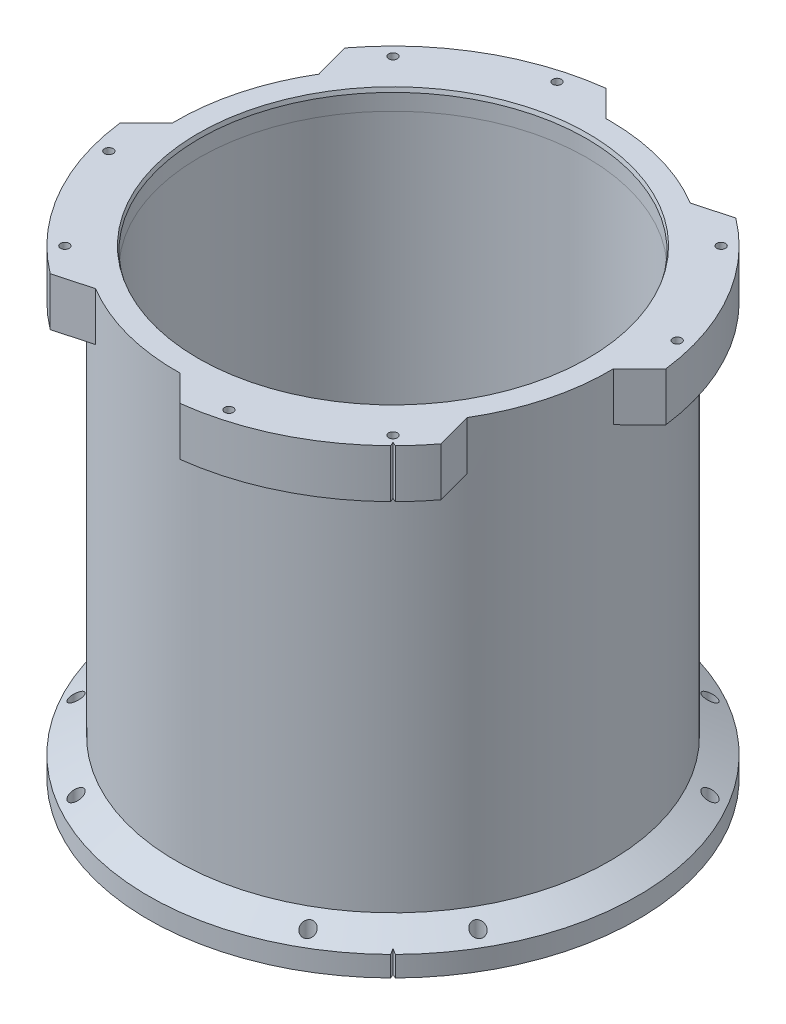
ISO-10303-21;
HEADER;
FILE_DESCRIPTION(('STEP AP214'),'2;1');
FILE_NAME('part.step','',(''),(''),'','','');
FILE_SCHEMA(('AUTOMOTIVE_DESIGN { 1 0 10303 214 1 1 1 1 }'));
ENDSEC;
DATA;
#1=APPLICATION_CONTEXT('core data for automotive mechanical design processes');
#2=APPLICATION_PROTOCOL_DEFINITION('international standard','automotive_design',2000,#1);
#3=PRODUCT_CONTEXT('',#1,'mechanical');
#4=PRODUCT('Part','Part','',(#3));
#5=PRODUCT_RELATED_PRODUCT_CATEGORY('part','',(#4));
#6=PRODUCT_DEFINITION_FORMATION('','',#4);
#7=PRODUCT_DEFINITION_CONTEXT('part definition',#1,'design');
#8=PRODUCT_DEFINITION('design','',#6,#7);
#9=PRODUCT_DEFINITION_SHAPE('','',#8);
#10=(LENGTH_UNIT() NAMED_UNIT(*) SI_UNIT(.MILLI.,.METRE.));
#11=(NAMED_UNIT(*) PLANE_ANGLE_UNIT() SI_UNIT($,.RADIAN.));
#12=(NAMED_UNIT(*) SI_UNIT($,.STERADIAN.) SOLID_ANGLE_UNIT());
#13=UNCERTAINTY_MEASURE_WITH_UNIT(LENGTH_MEASURE(1.E-05),#10,'distance_accuracy_value','');
#14=(GEOMETRIC_REPRESENTATION_CONTEXT(3) GLOBAL_UNCERTAINTY_ASSIGNED_CONTEXT((#13)) GLOBAL_UNIT_ASSIGNED_CONTEXT((#10,
#11,#12)) REPRESENTATION_CONTEXT('',''));
#15=CARTESIAN_POINT('',(0.,0.,0.));
#16=DIRECTION('',(0.,0.,1.));
#17=DIRECTION('',(1.,0.,0.));
#18=AXIS2_PLACEMENT_3D('',#15,#16,#17);
#19=CARTESIAN_POINT('',(0.,0.,0.));
#20=DIRECTION('',(0.,-1.,0.));
#21=DIRECTION('',(0.,0.,-1.));
#22=AXIS2_PLACEMENT_3D('',#19,#20,#21);
#23=CYLINDRICAL_SURFACE('',#22,76.2);
#24=DIRECTION('',(0.,1.,0.));
#25=VECTOR('',#24,1.);
#26=CARTESIAN_POINT('',(-75.6320167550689,-0.001000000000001,9.28644396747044));
#27=LINE('',#26,#25);
#28=CARTESIAN_POINT('',(-75.6320167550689,128.4224,9.28644396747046));
#29=VERTEX_POINT('',#28);
#30=CARTESIAN_POINT('',(-75.6320167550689,143.51,9.28644396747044));
#31=VERTEX_POINT('',#30);
#32=EDGE_CURVE('E209',#29,#31,#27,.T.);
#33=ORIENTED_EDGE('',*,*,#32,.F.);
#34=CARTESIAN_POINT('',(0.,128.4224,0.));
#35=DIRECTION('',(0.,-1.,0.));
#36=DIRECTION('',(0.,0.,-1.));
#37=AXIS2_PLACEMENT_3D('',#34,#35,#36);
#38=CIRCLE('',#37,76.2);
#39=CARTESIAN_POINT('',(-45.8583047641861,128.4224,60.8560258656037));
#40=VERTEX_POINT('',#39);
#41=EDGE_CURVE('E223',#40,#29,#38,.T.);
#42=ORIENTED_EDGE('',*,*,#41,.F.);
#43=DIRECTION('',(0.,1.,0.));
#44=VECTOR('',#43,1.);
#45=CARTESIAN_POINT('',(-45.8583047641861,-0.001000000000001,60.8560258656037));
#46=LINE('',#45,#44);
#47=CARTESIAN_POINT('',(-45.8583047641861,143.51,60.8560258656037));
#48=VERTEX_POINT('',#47);
#49=EDGE_CURVE('E1083',#40,#48,#46,.T.);
#50=ORIENTED_EDGE('',*,*,#49,.T.);
#51=CARTESIAN_POINT('',(0.,143.51,0.));
#52=DIRECTION('',(0.,-1.,0.));
#53=DIRECTION('',(0.,0.,-1.));
#54=AXIS2_PLACEMENT_3D('',#51,#52,#53);
#55=CIRCLE('',#54,76.2);
#56=EDGE_CURVE('E225',#48,#31,#55,.T.);
#57=ORIENTED_EDGE('',*,*,#56,.T.);
#58=EDGE_LOOP('',(#33,#42,#50,#57));
#59=FACE_BOUND('',#58,.T.);
#60=ADVANCED_FACE('F47',(#59),#23,.T.);
#61=CARTESIAN_POINT('',(67.46875,128.4224,0.));
#62=DIRECTION('',(0.,-1.,0.));
#63=DIRECTION('',(0.,0.,-1.));
#64=AXIS2_PLACEMENT_3D('',#61,#62,#63);
#65=PLANE('',#64);
#66=DIRECTION('',(0.709906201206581,0.,-0.704296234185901));
#67=VECTOR('',#66,1.);
#68=CARTESIAN_POINT('',(-67.4584741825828,128.4224,1.17749204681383));
#69=LINE('',#68,#67);
#70=CARTESIAN_POINT('',(-67.4584741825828,128.4224,1.17749204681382));
#71=VERTEX_POINT('',#70);
#72=EDGE_CURVE('E205',#29,#71,#69,.T.);
#73=ORIENTED_EDGE('',*,*,#72,.T.);
#74=CARTESIAN_POINT('',(0.,128.4224,0.));
#75=DIRECTION('',(0.,-1.,0.));
#76=DIRECTION('',(0.,0.,-1.));
#77=AXIS2_PLACEMENT_3D('',#74,#75,#76);
#78=CIRCLE('',#77,67.46875);
#79=CARTESIAN_POINT('',(-34.7489751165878,128.4224,57.8320063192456));
#80=VERTEX_POINT('',#79);
#81=EDGE_CURVE('E259',#80,#71,#78,.T.);
#82=ORIENTED_EDGE('',*,*,#81,.F.);
#83=DIRECTION('',(-0.964891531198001,0.,0.262648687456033));
#84=VECTOR('',#83,1.);
#85=CARTESIAN_POINT('',(-34.7489751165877,128.4224,57.8320063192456));
#86=LINE('',#85,#84);
#87=EDGE_CURVE('E216',#80,#40,#86,.T.);
#88=ORIENTED_EDGE('',*,*,#87,.T.);
#89=ORIENTED_EDGE('',*,*,#41,.T.);
#90=EDGE_LOOP('',(#73,#82,#88,#89));
#91=FACE_BOUND('',#90,.T.);
#92=CARTESIAN_POINT('',(-69.7700298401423,128.4224,18.6948231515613));
#93=DIRECTION('',(0.,-1.,0.));
#94=DIRECTION('',(0.,0.,-1.));
#95=AXIS2_PLACEMENT_3D('',#92,#93,#94);
#96=CIRCLE('',#95,1.35254999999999);
#97=CARTESIAN_POINT('',(-69.7700298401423,128.4224,17.3422731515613));
#98=VERTEX_POINT('',#97);
#99=EDGE_CURVE('E342',#98,#98,#96,.T.);
#100=ORIENTED_EDGE('',*,*,#99,.F.);
#101=EDGE_LOOP('',(#100));
#102=FACE_BOUND('',#101,.T.);
#103=CARTESIAN_POINT('',(-51.0752066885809,128.4224,51.0752066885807));
#104=DIRECTION('',(0.,-1.,0.));
#105=DIRECTION('',(0.,0.,-1.));
#106=AXIS2_PLACEMENT_3D('',#103,#104,#105);
#107=CIRCLE('',#106,1.35255);
#108=CARTESIAN_POINT('',(-51.0752066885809,128.4224,49.7226566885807));
#109=VERTEX_POINT('',#108);
#110=EDGE_CURVE('E336',#109,#109,#107,.T.);
#111=ORIENTED_EDGE('',*,*,#110,.F.);
#112=EDGE_LOOP('',(#111));
#113=FACE_BOUND('',#112,.T.);
#114=ADVANCED_FACE('F230',(#91,#102,#113),#65,.T.);
#115=DIRECTION('',(0.,1.,0.));
#116=VECTOR('',#115,1.);
#117=CARTESIAN_POINT('',(9.28644396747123,-0.001000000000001,75.6320167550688));
#118=LINE('',#117,#116);
#119=CARTESIAN_POINT('',(9.28644396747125,128.4224,75.6320167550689));
#120=VERTEX_POINT('',#119);
#121=CARTESIAN_POINT('',(9.28644396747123,143.51,75.6320167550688));
#122=VERTEX_POINT('',#121);
#123=EDGE_CURVE('E1082',#120,#122,#118,.T.);
#124=ORIENTED_EDGE('',*,*,#123,.F.);
#125=CARTESIAN_POINT('',(53.5088123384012,128.4224,54.2517004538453));
#126=VERTEX_POINT('',#125);
#127=EDGE_CURVE('E233',#126,#120,#38,.T.);
#128=ORIENTED_EDGE('',*,*,#127,.F.);
#129=DIRECTION('',(0.,-1.,0.));
#130=VECTOR('',#129,1.);
#131=CARTESIAN_POINT('',(53.5088123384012,0.,54.2517004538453));
#132=LINE('',#131,#130);
#133=CARTESIAN_POINT('',(53.5088123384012,143.51,54.2517004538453));
#134=VERTEX_POINT('',#133);
#135=EDGE_CURVE('E370',#126,#134,#132,.F.);
#136=ORIENTED_EDGE('',*,*,#135,.T.);
#137=EDGE_CURVE('E454',#134,#122,#55,.T.);
#138=ORIENTED_EDGE('',*,*,#137,.T.);
#139=EDGE_LOOP('',(#124,#128,#136,#138));
#140=FACE_BOUND('',#139,.T.);
#141=ADVANCED_FACE('F492',(#140),#23,.T.);
#142=DIRECTION('',(-0.704296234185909,0.,-0.709906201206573));
#143=VECTOR('',#142,1.);
#144=CARTESIAN_POINT('',(1.17749204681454,128.4224,67.4584741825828));
#145=LINE('',#144,#143);
#146=CARTESIAN_POINT('',(1.17749204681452,128.4224,67.4584741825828));
#147=VERTEX_POINT('',#146);
#148=EDGE_CURVE('E1085',#120,#147,#145,.T.);
#149=ORIENTED_EDGE('',*,*,#148,.T.);
#150=CARTESIAN_POINT('',(57.8320063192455,128.4224,34.7489751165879));
#151=VERTEX_POINT('',#150);
#152=EDGE_CURVE('E253',#151,#147,#78,.T.);
#153=ORIENTED_EDGE('',*,*,#152,.F.);
#154=DIRECTION('',(0.26264868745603,0.,0.964891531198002));
#155=VECTOR('',#154,1.);
#156=CARTESIAN_POINT('',(57.8320063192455,128.4224,34.7489751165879));
#157=LINE('',#156,#155);
#158=CARTESIAN_POINT('',(60.8560258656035,128.4224,45.8583047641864));
#159=VERTEX_POINT('',#158);
#160=EDGE_CURVE('E1092',#151,#159,#157,.T.);
#161=ORIENTED_EDGE('',*,*,#160,.T.);
#162=CARTESIAN_POINT('',(54.2517004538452,128.4224,53.5088123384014));
#163=VERTEX_POINT('',#162);
#164=EDGE_CURVE('E236',#159,#163,#38,.T.);
#165=ORIENTED_EDGE('',*,*,#164,.T.);
#166=DIRECTION('',(-0.923879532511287,0.,-0.382683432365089));
#167=VECTOR('',#166,1.);
#168=CARTESIAN_POINT('',(46.6149358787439,128.4224,50.3455608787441));
#169=LINE('',#168,#167);
#170=CARTESIAN_POINT('',(52.9835111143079,128.4224,52.9835111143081));
#171=VERTEX_POINT('',#170);
#172=EDGE_CURVE('E593',#163,#171,#169,.T.);
#173=ORIENTED_EDGE('',*,*,#172,.T.);
#174=DIRECTION('',(0.382683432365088,0.,0.923879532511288));
#175=VECTOR('',#174,1.);
#176=CARTESIAN_POINT('',(36.372325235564,128.4224,12.8805608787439));
#177=LINE('',#176,#175);
#178=EDGE_CURVE('E373',#171,#126,#177,.T.);
#179=ORIENTED_EDGE('',*,*,#178,.T.);
#180=ORIENTED_EDGE('',*,*,#127,.T.);
#181=EDGE_LOOP('',(#149,#153,#161,#165,#173,#179,#180));
#182=FACE_BOUND('',#181,.T.);
#183=CARTESIAN_POINT('',(18.6948231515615,128.4224,69.7700298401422));
#184=DIRECTION('',(0.,-1.,0.));
#185=DIRECTION('',(0.,0.,-1.));
#186=AXIS2_PLACEMENT_3D('',#183,#184,#185);
#187=CIRCLE('',#186,1.35255);
#188=CARTESIAN_POINT('',(18.6948231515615,128.4224,68.4174798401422));
#189=VERTEX_POINT('',#188);
#190=EDGE_CURVE('E330',#189,#189,#187,.T.);
#191=ORIENTED_EDGE('',*,*,#190,.F.);
#192=EDGE_LOOP('',(#191));
#193=FACE_BOUND('',#192,.T.);
#194=CARTESIAN_POINT('',(51.0752066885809,128.4224,51.0752066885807));
#195=DIRECTION('',(0.,-1.,0.));
#196=DIRECTION('',(0.,0.,-1.));
#197=AXIS2_PLACEMENT_3D('',#194,#195,#196);
#198=CIRCLE('',#197,1.35255);
#199=CARTESIAN_POINT('',(51.0752066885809,128.4224,49.7226566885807));
#200=VERTEX_POINT('',#199);
#201=EDGE_CURVE('E324',#200,#200,#198,.T.);
#202=ORIENTED_EDGE('',*,*,#201,.F.);
#203=EDGE_LOOP('',(#202));
#204=FACE_BOUND('',#203,.T.);
#205=ADVANCED_FACE('F498',(#182,#193,#204),#65,.T.);
#206=DIRECTION('',(0.,1.,0.));
#207=VECTOR('',#206,1.);
#208=CARTESIAN_POINT('',(75.6320167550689,-0.001000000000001,-9.28644396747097));
#209=LINE('',#208,#207);
#210=CARTESIAN_POINT('',(75.6320167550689,128.4224,-9.28644396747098));
#211=VERTEX_POINT('',#210);
#212=CARTESIAN_POINT('',(75.6320167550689,143.51,-9.28644396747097));
#213=VERTEX_POINT('',#212);
#214=EDGE_CURVE('E531',#211,#213,#209,.T.);
#215=ORIENTED_EDGE('',*,*,#214,.F.);
#216=CARTESIAN_POINT('',(45.8583047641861,128.4224,-60.8560258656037));
#217=VERTEX_POINT('',#216);
#218=EDGE_CURVE('E240',#217,#211,#38,.T.);
#219=ORIENTED_EDGE('',*,*,#218,.F.);
#220=DIRECTION('',(0.,1.,0.));
#221=VECTOR('',#220,1.);
#222=CARTESIAN_POINT('',(45.8583047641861,-0.001000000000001,-60.8560258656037));
#223=LINE('',#222,#221);
#224=CARTESIAN_POINT('',(45.8583047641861,143.51,-60.8560258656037));
#225=VERTEX_POINT('',#224);
#226=EDGE_CURVE('E561',#217,#225,#223,.T.);
#227=ORIENTED_EDGE('',*,*,#226,.T.);
#228=EDGE_CURVE('E534',#225,#213,#55,.T.);
#229=ORIENTED_EDGE('',*,*,#228,.T.);
#230=EDGE_LOOP('',(#215,#219,#227,#229));
#231=FACE_BOUND('',#230,.T.);
#232=ADVANCED_FACE('F503',(#231),#23,.T.);
#233=DIRECTION('',(-0.709906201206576,0.,0.704296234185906));
#234=VECTOR('',#233,1.);
#235=CARTESIAN_POINT('',(67.4584741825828,128.4224,-1.17749204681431));
#236=LINE('',#235,#234);
#237=CARTESIAN_POINT('',(67.4584741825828,128.4224,-1.17749204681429));
#238=VERTEX_POINT('',#237);
#239=EDGE_CURVE('E544',#211,#238,#236,.T.);
#240=ORIENTED_EDGE('',*,*,#239,.T.);
#241=CARTESIAN_POINT('',(34.7489751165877,128.4224,-57.8320063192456));
#242=VERTEX_POINT('',#241);
#243=EDGE_CURVE('E244',#242,#238,#78,.T.);
#244=ORIENTED_EDGE('',*,*,#243,.F.);
#245=DIRECTION('',(0.964891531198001,0.,-0.262648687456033));
#246=VECTOR('',#245,1.);
#247=CARTESIAN_POINT('',(34.7489751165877,128.4224,-57.8320063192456));
#248=LINE('',#247,#246);
#249=EDGE_CURVE('E546',#242,#217,#248,.T.);
#250=ORIENTED_EDGE('',*,*,#249,.T.);
#251=ORIENTED_EDGE('',*,*,#218,.T.);
#252=EDGE_LOOP('',(#240,#244,#250,#251));
#253=FACE_BOUND('',#252,.T.);
#254=CARTESIAN_POINT('',(69.7700298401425,128.4224,-18.6948231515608));
#255=DIRECTION('',(0.,-1.,0.));
#256=DIRECTION('',(0.,0.,-1.));
#257=AXIS2_PLACEMENT_3D('',#254,#255,#256);
#258=CIRCLE('',#257,1.35254999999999);
#259=CARTESIAN_POINT('',(69.7700298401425,128.4224,-20.0473731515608));
#260=VERTEX_POINT('',#259);
#261=EDGE_CURVE('E364',#260,#260,#258,.T.);
#262=ORIENTED_EDGE('',*,*,#261,.F.);
#263=EDGE_LOOP('',(#262));
#264=FACE_BOUND('',#263,.T.);
#265=CARTESIAN_POINT('',(51.0752066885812,128.4224,-51.0752066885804));
#266=DIRECTION('',(0.,-1.,0.));
#267=DIRECTION('',(0.,0.,-1.));
#268=AXIS2_PLACEMENT_3D('',#265,#266,#267);
#269=CIRCLE('',#268,1.35255);
#270=CARTESIAN_POINT('',(51.0752066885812,128.4224,-52.4277566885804));
#271=VERTEX_POINT('',#270);
#272=EDGE_CURVE('E358',#271,#271,#269,.T.);
#273=ORIENTED_EDGE('',*,*,#272,.F.);
#274=EDGE_LOOP('',(#273));
#275=FACE_BOUND('',#274,.T.);
#276=ADVANCED_FACE('F513',(#253,#264,#275),#65,.T.);
#277=DIRECTION('',(0.,1.,0.));
#278=VECTOR('',#277,1.);
#279=CARTESIAN_POINT('',(-60.8560258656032,-0.001000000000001,-45.8583047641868));
#280=LINE('',#279,#278);
#281=CARTESIAN_POINT('',(-60.8560258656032,128.4224,-45.8583047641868));
#282=VERTEX_POINT('',#281);
#283=CARTESIAN_POINT('',(-60.8560258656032,143.51,-45.8583047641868));
#284=VERTEX_POINT('',#283);
#285=EDGE_CURVE('E217',#282,#284,#280,.T.);
#286=ORIENTED_EDGE('',*,*,#285,.T.);
#287=CARTESIAN_POINT('',(-9.28644396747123,143.51,-75.6320167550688));
#288=VERTEX_POINT('',#287);
#289=EDGE_CURVE('E1064',#284,#288,#55,.T.);
#290=ORIENTED_EDGE('',*,*,#289,.T.);
#291=DIRECTION('',(0.,1.,0.));
#292=VECTOR('',#291,1.);
#293=CARTESIAN_POINT('',(-9.28644396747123,-0.001000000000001,-75.6320167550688));
#294=LINE('',#293,#292);
#295=CARTESIAN_POINT('',(-9.28644396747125,128.4224,-75.6320167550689));
#296=VERTEX_POINT('',#295);
#297=EDGE_CURVE('E560',#296,#288,#294,.T.);
#298=ORIENTED_EDGE('',*,*,#297,.F.);
#299=EDGE_CURVE('E234',#282,#296,#38,.T.);
#300=ORIENTED_EDGE('',*,*,#299,.F.);
#301=EDGE_LOOP('',(#286,#290,#298,#300));
#302=FACE_BOUND('',#301,.T.);
#303=ADVANCED_FACE('F507',(#302),#23,.T.);
#304=CARTESIAN_POINT('',(60.325,143.51,0.));
#305=DIRECTION('',(0.,1.,0.));
#306=DIRECTION('',(0.,0.,1.));
#307=AXIS2_PLACEMENT_3D('',#304,#305,#306);
#308=PLANE('',#307);
#309=DIRECTION('',(0.709906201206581,0.,-0.704296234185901));
#310=VECTOR('',#309,1.);
#311=CARTESIAN_POINT('',(-67.4584741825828,143.51,1.17749204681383));
#312=LINE('',#311,#310);
#313=CARTESIAN_POINT('',(-67.4584741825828,143.51,1.17749204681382));
#314=VERTEX_POINT('',#313);
#315=EDGE_CURVE('E1059',#31,#314,#312,.T.);
#316=ORIENTED_EDGE('',*,*,#315,.F.);
#317=ORIENTED_EDGE('',*,*,#56,.F.);
#318=DIRECTION('',(-0.964891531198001,0.,0.262648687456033));
#319=VECTOR('',#318,1.);
#320=CARTESIAN_POINT('',(-34.7489751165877,143.51,57.8320063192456));
#321=LINE('',#320,#319);
#322=CARTESIAN_POINT('',(-34.7489751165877,143.51,57.8320063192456));
#323=VERTEX_POINT('',#322);
#324=EDGE_CURVE('E1080',#323,#48,#321,.T.);
#325=ORIENTED_EDGE('',*,*,#324,.F.);
#326=CARTESIAN_POINT('',(0.,143.51,0.));
#327=DIRECTION('',(0.,-1.,0.));
#328=DIRECTION('',(0.,0.,-1.));
#329=AXIS2_PLACEMENT_3D('',#326,#327,#328);
#330=CIRCLE('',#329,67.46875);
#331=CARTESIAN_POINT('',(1.17749204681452,143.51,67.4584741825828));
#332=VERTEX_POINT('',#331);
#333=EDGE_CURVE('E1078',#332,#323,#330,.T.);
#334=ORIENTED_EDGE('',*,*,#333,.F.);
#335=DIRECTION('',(-0.704296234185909,0.,-0.709906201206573));
#336=VECTOR('',#335,1.);
#337=CARTESIAN_POINT('',(1.17749204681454,143.51,67.4584741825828));
#338=LINE('',#337,#336);
#339=EDGE_CURVE('E1075',#122,#332,#338,.T.);
#340=ORIENTED_EDGE('',*,*,#339,.F.);
#341=ORIENTED_EDGE('',*,*,#137,.F.);
#342=DIRECTION('',(0.382683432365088,0.,0.923879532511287));
#343=VECTOR('',#342,1.);
#344=CARTESIAN_POINT('',(52.9835111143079,143.51,52.9835111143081));
#345=LINE('',#344,#343);
#346=CARTESIAN_POINT('',(52.9835111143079,143.51,52.9835111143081));
#347=VERTEX_POINT('',#346);
#348=EDGE_CURVE('E575',#347,#134,#345,.T.);
#349=ORIENTED_EDGE('',*,*,#348,.F.);
#350=DIRECTION('',(-0.923879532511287,0.,-0.382683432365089));
#351=VECTOR('',#350,1.);
#352=CARTESIAN_POINT('',(52.9835111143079,143.51,52.9835111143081));
#353=LINE('',#352,#351);
#354=CARTESIAN_POINT('',(54.2517004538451,143.51,53.5088123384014));
#355=VERTEX_POINT('',#354);
#356=EDGE_CURVE('E577',#355,#347,#353,.T.);
#357=ORIENTED_EDGE('',*,*,#356,.F.);
#358=CARTESIAN_POINT('',(60.8560258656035,143.51,45.8583047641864));
#359=VERTEX_POINT('',#358);
#360=EDGE_CURVE('E239',#359,#355,#55,.T.);
#361=ORIENTED_EDGE('',*,*,#360,.F.);
#362=DIRECTION('',(0.26264868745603,0.,0.964891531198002));
#363=VECTOR('',#362,1.);
#364=CARTESIAN_POINT('',(57.8320063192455,143.51,34.7489751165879));
#365=LINE('',#364,#363);
#366=CARTESIAN_POINT('',(57.8320063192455,143.51,34.7489751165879));
#367=VERTEX_POINT('',#366);
#368=EDGE_CURVE('E539',#367,#359,#365,.T.);
#369=ORIENTED_EDGE('',*,*,#368,.F.);
#370=CARTESIAN_POINT('',(0.,143.51,0.));
#371=DIRECTION('',(0.,-1.,0.));
#372=DIRECTION('',(-1.,0.,0.));
#373=AXIS2_PLACEMENT_3D('',#370,#371,#372);
#374=CIRCLE('',#373,67.46875);
#375=CARTESIAN_POINT('',(67.4584741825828,143.51,-1.17749204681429));
#376=VERTEX_POINT('',#375);
#377=EDGE_CURVE('E1096',#376,#367,#374,.T.);
#378=ORIENTED_EDGE('',*,*,#377,.F.);
#379=DIRECTION('',(-0.709906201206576,0.,0.704296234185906));
#380=VECTOR('',#379,1.);
#381=CARTESIAN_POINT('',(67.4584741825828,143.51,-1.17749204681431));
#382=LINE('',#381,#380);
#383=EDGE_CURVE('E1094',#213,#376,#382,.T.);
#384=ORIENTED_EDGE('',*,*,#383,.F.);
#385=ORIENTED_EDGE('',*,*,#228,.F.);
#386=DIRECTION('',(0.964891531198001,0.,-0.262648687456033));
#387=VECTOR('',#386,1.);
#388=CARTESIAN_POINT('',(34.7489751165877,143.51,-57.8320063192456));
#389=LINE('',#388,#387);
#390=CARTESIAN_POINT('',(34.7489751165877,143.51,-57.8320063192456));
#391=VERTEX_POINT('',#390);
#392=EDGE_CURVE('E558',#391,#225,#389,.T.);
#393=ORIENTED_EDGE('',*,*,#392,.F.);
#394=CARTESIAN_POINT('',(0.,143.51,0.));
#395=DIRECTION('',(0.,-1.,0.));
#396=DIRECTION('',(0.,0.,1.));
#397=AXIS2_PLACEMENT_3D('',#394,#395,#396);
#398=CIRCLE('',#397,67.46875);
#399=CARTESIAN_POINT('',(-1.17749204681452,143.51,-67.4584741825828));
#400=VERTEX_POINT('',#399);
#401=EDGE_CURVE('E551',#400,#391,#398,.T.);
#402=ORIENTED_EDGE('',*,*,#401,.F.);
#403=DIRECTION('',(0.704296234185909,0.,0.709906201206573));
#404=VECTOR('',#403,1.);
#405=CARTESIAN_POINT('',(-1.17749204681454,143.51,-67.4584741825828));
#406=LINE('',#405,#404);
#407=EDGE_CURVE('E548',#288,#400,#406,.T.);
#408=ORIENTED_EDGE('',*,*,#407,.F.);
#409=ORIENTED_EDGE('',*,*,#289,.F.);
#410=DIRECTION('',(-0.262648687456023,0.,-0.964891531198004));
#411=VECTOR('',#410,1.);
#412=CARTESIAN_POINT('',(-57.8320063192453,143.51,-34.7489751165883));
#413=LINE('',#412,#411);
#414=CARTESIAN_POINT('',(-57.8320063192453,143.51,-34.7489751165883));
#415=VERTEX_POINT('',#414);
#416=EDGE_CURVE('E227',#415,#284,#413,.T.);
#417=ORIENTED_EDGE('',*,*,#416,.F.);
#418=CARTESIAN_POINT('',(0.,143.51,0.));
#419=DIRECTION('',(0.,-1.,0.));
#420=DIRECTION('',(1.,0.,0.));
#421=AXIS2_PLACEMENT_3D('',#418,#419,#420);
#422=CIRCLE('',#421,67.46875);
#423=EDGE_CURVE('E1056',#314,#415,#422,.T.);
#424=ORIENTED_EDGE('',*,*,#423,.F.);
#425=EDGE_LOOP('',(#316,#317,#325,#334,#340,#341,#349,#357,#361,#369,#378,#384,#385,#393,#402,
#408,#409,#417,#424));
#426=FACE_BOUND('',#425,.T.);
#427=CARTESIAN_POINT('',(0.,143.51,0.));
#428=DIRECTION('',(0.,1.,0.));
#429=DIRECTION('',(0.,0.,1.));
#430=AXIS2_PLACEMENT_3D('',#427,#428,#429);
#431=CIRCLE('',#430,60.6652954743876);
#432=CARTESIAN_POINT('',(0.,143.51,60.6652954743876));
#433=VERTEX_POINT('',#432);
#434=EDGE_CURVE('E449',#433,#433,#431,.F.);
#435=ORIENTED_EDGE('',*,*,#434,.T.);
#436=EDGE_LOOP('',(#435));
#437=FACE_BOUND('',#436,.T.);
#438=CARTESIAN_POINT('',(51.0752066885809,143.51,51.0752066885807));
#439=DIRECTION('',(0.,1.,0.));
#440=DIRECTION('',(0.,0.,1.));
#441=AXIS2_PLACEMENT_3D('',#438,#439,#440);
#442=CIRCLE('',#441,1.35255);
#443=CARTESIAN_POINT('',(51.0752066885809,143.51,52.4277566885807));
#444=VERTEX_POINT('',#443);
#445=EDGE_CURVE('E327',#444,#444,#442,.T.);
#446=ORIENTED_EDGE('',*,*,#445,.F.);
#447=EDGE_LOOP('',(#446));
#448=FACE_BOUND('',#447,.T.);
#449=CARTESIAN_POINT('',(18.6948231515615,143.51,69.7700298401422));
#450=DIRECTION('',(0.,1.,0.));
#451=DIRECTION('',(0.,0.,1.));
#452=AXIS2_PLACEMENT_3D('',#449,#450,#451);
#453=CIRCLE('',#452,1.35255);
#454=CARTESIAN_POINT('',(18.6948231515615,143.51,71.1225798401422));
#455=VERTEX_POINT('',#454);
#456=EDGE_CURVE('E333',#455,#455,#453,.T.);
#457=ORIENTED_EDGE('',*,*,#456,.F.);
#458=EDGE_LOOP('',(#457));
#459=FACE_BOUND('',#458,.T.);
#460=CARTESIAN_POINT('',(-51.0752066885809,143.51,51.0752066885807));
#461=DIRECTION('',(0.,1.,0.));
#462=DIRECTION('',(0.,0.,1.));
#463=AXIS2_PLACEMENT_3D('',#460,#461,#462);
#464=CIRCLE('',#463,1.35255);
#465=CARTESIAN_POINT('',(-51.0752066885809,143.51,52.4277566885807));
#466=VERTEX_POINT('',#465);
#467=EDGE_CURVE('E339',#466,#466,#464,.T.);
#468=ORIENTED_EDGE('',*,*,#467,.F.);
#469=EDGE_LOOP('',(#468));
#470=FACE_BOUND('',#469,.T.);
#471=CARTESIAN_POINT('',(-69.7700298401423,143.51,18.6948231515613));
#472=DIRECTION('',(0.,1.,0.));
#473=DIRECTION('',(0.,0.,1.));
#474=AXIS2_PLACEMENT_3D('',#471,#472,#473);
#475=CIRCLE('',#474,1.35254999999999);
#476=CARTESIAN_POINT('',(-69.7700298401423,143.51,20.0473731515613));
#477=VERTEX_POINT('',#476);
#478=EDGE_CURVE('E345',#477,#477,#475,.T.);
#479=ORIENTED_EDGE('',*,*,#478,.F.);
#480=EDGE_LOOP('',(#479));
#481=FACE_BOUND('',#480,.T.);
#482=CARTESIAN_POINT('',(-51.0752066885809,143.51,-51.0752066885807));
#483=DIRECTION('',(0.,1.,0.));
#484=DIRECTION('',(0.,0.,1.));
#485=AXIS2_PLACEMENT_3D('',#482,#483,#484);
#486=CIRCLE('',#485,1.35255);
#487=CARTESIAN_POINT('',(-51.0752066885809,143.51,-49.7226566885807));
#488=VERTEX_POINT('',#487);
#489=EDGE_CURVE('E350',#488,#488,#486,.T.);
#490=ORIENTED_EDGE('',*,*,#489,.F.);
#491=EDGE_LOOP('',(#490));
#492=FACE_BOUND('',#491,.T.);
#493=CARTESIAN_POINT('',(-18.694823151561,143.51,-69.7700298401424));
#494=DIRECTION('',(0.,1.,0.));
#495=DIRECTION('',(0.,0.,1.));
#496=AXIS2_PLACEMENT_3D('',#493,#494,#495);
#497=CIRCLE('',#496,1.35255);
#498=CARTESIAN_POINT('',(-18.694823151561,143.51,-68.4174798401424));
#499=VERTEX_POINT('',#498);
#500=EDGE_CURVE('E355',#499,#499,#497,.T.);
#501=ORIENTED_EDGE('',*,*,#500,.F.);
#502=EDGE_LOOP('',(#501));
#503=FACE_BOUND('',#502,.T.);
#504=CARTESIAN_POINT('',(51.0752066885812,143.51,-51.0752066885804));
#505=DIRECTION('',(0.,1.,0.));
#506=DIRECTION('',(0.,0.,1.));
#507=AXIS2_PLACEMENT_3D('',#504,#505,#506);
#508=CIRCLE('',#507,1.35255);
#509=CARTESIAN_POINT('',(51.0752066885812,143.51,-49.7226566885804));
#510=VERTEX_POINT('',#509);
#511=EDGE_CURVE('E361',#510,#510,#508,.T.);
#512=ORIENTED_EDGE('',*,*,#511,.F.);
#513=EDGE_LOOP('',(#512));
#514=FACE_BOUND('',#513,.T.);
#515=CARTESIAN_POINT('',(69.7700298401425,143.51,-18.6948231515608));
#516=DIRECTION('',(0.,1.,0.));
#517=DIRECTION('',(0.,0.,1.));
#518=AXIS2_PLACEMENT_3D('',#515,#516,#517);
#519=CIRCLE('',#518,1.35254999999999);
#520=CARTESIAN_POINT('',(69.7700298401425,143.51,-17.3422731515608));
#521=VERTEX_POINT('',#520);
#522=EDGE_CURVE('E367',#521,#521,#519,.T.);
#523=ORIENTED_EDGE('',*,*,#522,.F.);
#524=EDGE_LOOP('',(#523));
#525=FACE_BOUND('',#524,.T.);
#526=ADVANCED_FACE('F505',(#426,#437,#448,#459,#470,#481,#492,#503,#514,#525),#308,.T.);
#527=DIRECTION('',(0.,1.,0.));
#528=VECTOR('',#527,1.);
#529=CARTESIAN_POINT('',(60.8560258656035,-0.001000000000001,45.8583047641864));
#530=LINE('',#529,#528);
#531=EDGE_CURVE('E553',#159,#359,#530,.T.);
#532=ORIENTED_EDGE('',*,*,#531,.T.);
#533=ORIENTED_EDGE('',*,*,#360,.T.);
#534=DIRECTION('',(0.,-1.,0.));
#535=VECTOR('',#534,1.);
#536=CARTESIAN_POINT('',(54.2517004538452,0.,53.5088123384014));
#537=LINE('',#536,#535);
#538=EDGE_CURVE('E594',#355,#163,#537,.T.);
#539=ORIENTED_EDGE('',*,*,#538,.T.);
#540=ORIENTED_EDGE('',*,*,#164,.F.);
#541=EDGE_LOOP('',(#532,#533,#539,#540));
#542=FACE_BOUND('',#541,.T.);
#543=ADVANCED_FACE('F493',(#542),#23,.T.);
#544=DIRECTION('',(-0.262648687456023,0.,-0.964891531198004));
#545=VECTOR('',#544,1.);
#546=CARTESIAN_POINT('',(-57.8320063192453,128.4224,-34.7489751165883));
#547=LINE('',#546,#545);
#548=CARTESIAN_POINT('',(-57.8320063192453,128.4224,-34.7489751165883));
#549=VERTEX_POINT('',#548);
#550=EDGE_CURVE('E1052',#549,#282,#547,.T.);
#551=ORIENTED_EDGE('',*,*,#550,.T.);
#552=ORIENTED_EDGE('',*,*,#299,.T.);
#553=DIRECTION('',(0.704296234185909,0.,0.709906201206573));
#554=VECTOR('',#553,1.);
#555=CARTESIAN_POINT('',(-1.17749204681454,128.4224,-67.4584741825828));
#556=LINE('',#555,#554);
#557=CARTESIAN_POINT('',(-1.17749204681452,128.4224,-67.4584741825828));
#558=VERTEX_POINT('',#557);
#559=EDGE_CURVE('E563',#296,#558,#556,.T.);
#560=ORIENTED_EDGE('',*,*,#559,.T.);
#561=EDGE_CURVE('E254',#549,#558,#78,.T.);
#562=ORIENTED_EDGE('',*,*,#561,.F.);
#563=EDGE_LOOP('',(#551,#552,#560,#562));
#564=FACE_BOUND('',#563,.T.);
#565=CARTESIAN_POINT('',(-51.0752066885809,128.4224,-51.0752066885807));
#566=DIRECTION('',(0.,-1.,0.));
#567=DIRECTION('',(0.,0.,-1.));
#568=AXIS2_PLACEMENT_3D('',#565,#566,#567);
#569=CIRCLE('',#568,1.35255);
#570=CARTESIAN_POINT('',(-51.0752066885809,128.4224,-52.4277566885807));
#571=VERTEX_POINT('',#570);
#572=EDGE_CURVE('E349',#571,#571,#569,.T.);
#573=ORIENTED_EDGE('',*,*,#572,.F.);
#574=EDGE_LOOP('',(#573));
#575=FACE_BOUND('',#574,.T.);
#576=CARTESIAN_POINT('',(-18.694823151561,128.4224,-69.7700298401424));
#577=DIRECTION('',(0.,-1.,0.));
#578=DIRECTION('',(0.,0.,-1.));
#579=AXIS2_PLACEMENT_3D('',#576,#577,#578);
#580=CIRCLE('',#579,1.35255);
#581=CARTESIAN_POINT('',(-18.694823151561,128.4224,-71.1225798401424));
#582=VERTEX_POINT('',#581);
#583=EDGE_CURVE('E354',#582,#582,#580,.T.);
#584=ORIENTED_EDGE('',*,*,#583,.F.);
#585=EDGE_LOOP('',(#584));
#586=FACE_BOUND('',#585,.T.);
#587=ADVANCED_FACE('F499',(#564,#575,#586),#65,.T.);
#588=CARTESIAN_POINT('',(0.,6.35,0.));
#589=DIRECTION('',(0.,-1.,0.));
#590=DIRECTION('',(0.,0.,-1.));
#591=AXIS2_PLACEMENT_3D('',#588,#589,#590);
#592=CONICAL_SURFACE('',#591,76.2,1.04719755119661);
#593=CARTESIAN_POINT('',(0.,11.3909895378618,0.));
#594=DIRECTION('',(0.,-1.,0.));
#595=DIRECTION('',(0.,0.,-1.));
#596=AXIS2_PLACEMENT_3D('',#593,#594,#595);
#597=CIRCLE('',#596,67.46875);
#598=CARTESIAN_POINT('',(0.,11.3909895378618,-67.46875));
#599=VERTEX_POINT('',#598);
#600=EDGE_CURVE('E262',#599,#599,#597,.T.);
#601=ORIENTED_EDGE('',*,*,#600,.T.);
#602=EDGE_LOOP('',(#601));
#603=FACE_BOUND('',#602,.T.);
#604=CARTESIAN_POINT('',(61.3694184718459,8.7457193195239,37.7500719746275));
#605=CARTESIAN_POINT('',(61.4899435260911,8.65985159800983,37.8380019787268));
#606=CARTESIAN_POINT('',(61.620181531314,8.57326386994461,37.9125252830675));
#607=CARTESIAN_POINT('',(61.8952629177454,8.40196683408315,38.0315932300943));
#608=CARTESIAN_POINT('',(62.0401432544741,8.31726297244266,38.0760597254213));
#609=CARTESIAN_POINT('',(62.319427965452,8.16407313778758,38.1281088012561));
#610=CARTESIAN_POINT('',(62.4527022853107,8.09491974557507,38.1397748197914));
#611=CARTESIAN_POINT('',(62.7220535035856,7.96324322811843,38.1360429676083));
#612=CARTESIAN_POINT('',(62.8581259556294,7.9007104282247,38.120685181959));
#613=CARTESIAN_POINT('',(63.1158699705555,7.79029582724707,38.0640349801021));
#614=CARTESIAN_POINT('',(63.2377303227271,7.74160026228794,38.0252154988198));
#615=CARTESIAN_POINT('',(63.4748534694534,7.65440410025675,37.9233678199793));
#616=CARTESIAN_POINT('',(63.5901233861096,7.61589232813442,37.8603663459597));
#617=CARTESIAN_POINT('',(63.7929674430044,7.55601510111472,37.7216924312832));
#618=CARTESIAN_POINT('',(63.8821505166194,7.53299195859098,37.6490869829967));
#619=CARTESIAN_POINT('',(64.0478279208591,7.49747379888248,37.4884746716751));
#620=CARTESIAN_POINT('',(64.124334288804,7.48496874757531,37.400482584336));
#621=CARTESIAN_POINT('',(64.2533142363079,7.47204252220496,37.2231057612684));
#622=CARTESIAN_POINT('',(64.307551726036,7.47037965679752,37.1350862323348));
#623=CARTESIAN_POINT('',(64.4018474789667,7.47592066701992,36.9520305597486));
#624=CARTESIAN_POINT('',(64.4419095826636,7.48312213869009,36.8569963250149));
#625=CARTESIAN_POINT('',(64.5057418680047,7.50561674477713,36.6663764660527));
#626=CARTESIAN_POINT('',(64.5300425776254,7.52061185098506,36.5709316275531));
#627=CARTESIAN_POINT('',(64.5644465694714,7.55785564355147,36.378928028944));
#628=CARTESIAN_POINT('',(64.5745479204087,7.58010531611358,36.2823691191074));
#629=CARTESIAN_POINT('',(64.581136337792,7.63225896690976,36.085821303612));
#630=CARTESIAN_POINT('',(64.5769327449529,7.66248432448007,35.9858958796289));
#631=CARTESIAN_POINT('',(64.5543502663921,7.72890574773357,35.7897224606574));
#632=CARTESIAN_POINT('',(64.5359661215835,7.76510402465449,35.6934758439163));
#633=CARTESIAN_POINT('',(64.4835797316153,7.84654894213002,35.4964372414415));
#634=CARTESIAN_POINT('',(64.4481139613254,7.89234964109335,35.3962647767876));
#635=CARTESIAN_POINT('',(64.3631111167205,7.9885964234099,35.2045114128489));
#636=CARTESIAN_POINT('',(64.3135672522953,8.03904474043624,35.1129346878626));
#637=CARTESIAN_POINT('',(64.1949452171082,8.15013160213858,34.9285362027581));
#638=CARTESIAN_POINT('',(64.1241673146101,8.21124336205,34.8370920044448));
#639=CARTESIAN_POINT('',(63.9693100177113,8.33625231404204,34.6684894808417));
#640=CARTESIAN_POINT('',(63.8852239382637,8.40015089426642,34.5913383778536));
#641=CARTESIAN_POINT('',(63.6961723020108,8.5363528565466,34.4450120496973));
#642=CARTESIAN_POINT('',(63.58992958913,8.60881248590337,34.3776259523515));
#643=CARTESIAN_POINT('',(63.3666734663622,8.75352010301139,34.26355697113));
#644=CARTESIAN_POINT('',(63.2496555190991,8.82576798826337,34.2168828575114));
#645=CARTESIAN_POINT('',(63.0025567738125,8.97117338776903,34.1443029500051));
#646=CARTESIAN_POINT('',(62.8721311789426,9.04423737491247,34.1193720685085));
#647=CARTESIAN_POINT('',(62.6063095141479,9.18561750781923,34.0956378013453));
#648=CARTESIAN_POINT('',(62.4709135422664,9.25393374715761,34.0968339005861));
#649=CARTESIAN_POINT('',(62.2069597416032,9.37944015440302,34.1263443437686));
#650=CARTESIAN_POINT('',(62.0784331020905,9.43703456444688,34.1531713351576));
#651=CARTESIAN_POINT('',(61.8255636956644,9.54258437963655,34.232989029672));
#652=CARTESIAN_POINT('',(61.7012161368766,9.5905511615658,34.2859485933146));
#653=CARTESIAN_POINT('',(61.478922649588,9.66803656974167,34.4089541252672));
#654=CARTESIAN_POINT('',(61.3796967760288,9.69918449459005,34.4756521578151));
#655=CARTESIAN_POINT('',(61.1930155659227,9.75006033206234,34.627346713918));
#656=CARTESIAN_POINT('',(61.1055448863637,9.76980324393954,34.7123190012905));
#657=CARTESIAN_POINT('',(60.9581182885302,9.7945241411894,34.8843857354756));
#658=CARTESIAN_POINT('',(60.8960131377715,9.80122244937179,34.9694021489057));
#659=CARTESIAN_POINT('',(60.7857456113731,9.80483875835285,35.148213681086));
#660=CARTESIAN_POINT('',(60.7375770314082,9.80176111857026,35.2420048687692));
#661=CARTESIAN_POINT('',(60.6593463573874,9.78654979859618,35.42873752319));
#662=CARTESIAN_POINT('',(60.6282891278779,9.7750352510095,35.5213166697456));
#663=CARTESIAN_POINT('',(60.5800033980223,9.74424551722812,35.7087396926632));
#664=CARTESIAN_POINT('',(60.562775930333,9.72496975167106,35.8035837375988));
#665=CARTESIAN_POINT('',(60.5416060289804,9.67874046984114,35.996306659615));
#666=CARTESIAN_POINT('',(60.5381359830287,9.65154784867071,36.0941788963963));
#667=CARTESIAN_POINT('',(60.5450256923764,9.59088653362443,36.2874271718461));
#668=CARTESIAN_POINT('',(60.5553892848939,9.55741610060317,36.3828025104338));
#669=CARTESIAN_POINT('',(60.5906906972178,9.48146055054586,36.5792018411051));
#670=CARTESIAN_POINT('',(60.617067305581,9.43839436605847,36.6797406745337));
#671=CARTESIAN_POINT('',(60.6838971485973,9.34734154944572,36.8736927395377));
#672=CARTESIAN_POINT('',(60.7243630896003,9.29935050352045,36.9670994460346));
#673=CARTESIAN_POINT('',(60.8242483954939,9.19283070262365,37.157675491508));
#674=CARTESIAN_POINT('',(60.8855172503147,9.13376328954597,37.2535722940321));
#675=CARTESIAN_POINT('',(61.0219425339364,9.01263158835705,37.4325082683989));
#676=CARTESIAN_POINT('',(61.097080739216,8.95057131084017,37.5155640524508));
#677=CARTESIAN_POINT('',(61.2083822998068,8.86426264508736,37.6199728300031));
#678=CARTESIAN_POINT('',(61.2395036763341,8.84066059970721,37.6474077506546));
#679=CARTESIAN_POINT('',(61.3033068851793,8.79329729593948,37.7002632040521));
#680=CARTESIAN_POINT('',(61.3359890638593,8.769536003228,37.7256832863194));
#681=CARTESIAN_POINT('',(61.3694184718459,8.7457193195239,37.7500719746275));
#682=B_SPLINE_CURVE_WITH_KNOTS('',3,(#604,#605,#606,#607,#608,#609,#610,#611,#612,#613,#614,
#615,#616,#617,#618,#619,#620,#621,#622,#623,#624,#625,#626,#627,#628,#629,#630,#631,#632,#633,
#634,#635,#636,#637,#638,#639,#640,#641,#642,#643,#644,#645,#646,#647,#648,#649,#650,#651,#652,
#653,#654,#655,#656,#657,#658,#659,#660,#661,#662,#663,#664,#665,#666,#667,#668,#669,#670,#671,
#672,#673,#674,#675,#676,#677,#678,#679,#680,#681),.UNSPECIFIED.,.T.,.F.,(4,2,2,2,2,2,2,2,2,2,2,
2,2,2,2,2,2,2,2,2,2,2,2,2,2,2,2,2,2,2,2,2,2,2,2,2,2,2,4),(0.,0.516184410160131,1.03370578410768,
1.48312935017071,1.93188683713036,2.34003072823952,2.74772487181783,3.09756175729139,
3.44706452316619,3.75571136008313,4.06427451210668,4.36182276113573,4.65941147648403,
4.97156789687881,5.28384014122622,5.62960221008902,5.97553132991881,6.36630487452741,
6.75727534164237,7.19091084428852,7.62472979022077,8.07712545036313,8.52951219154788,
8.95714664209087,9.38427275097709,9.75270561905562,10.12065283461,10.4354711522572,
10.7501491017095,11.0437914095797,11.3374556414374,11.64112033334,11.9448692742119,
12.2810701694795,12.6175750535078,13.0007149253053,13.3833549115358,13.5264943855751,
13.669665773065),.UNSPECIFIED.);
#683=CARTESIAN_POINT('',(61.3694184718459,8.7457193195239,37.7500719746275));
#684=VERTEX_POINT('',#683);
#685=EDGE_CURVE('E292',#684,#684,#682,.T.);
#686=ORIENTED_EDGE('',*,*,#685,.F.);
#687=EDGE_LOOP('',(#686));
#688=FACE_BOUND('',#687,.T.);
#689=CARTESIAN_POINT('',(37.7500719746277,8.7457193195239,61.3694184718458));
#690=CARTESIAN_POINT('',(37.6758645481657,8.81818201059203,61.2677125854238));
#691=CARTESIAN_POINT('',(37.5919695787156,8.89028002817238,61.1727077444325));
#692=CARTESIAN_POINT('',(37.4065420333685,9.03175750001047,60.9990024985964));
#693=CARTESIAN_POINT('',(37.3049892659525,9.10113372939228,60.9203209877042));
#694=CARTESIAN_POINT('',(37.0858558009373,9.23516977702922,60.7821743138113));
#695=CARTESIAN_POINT('',(36.9682019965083,9.2998058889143,60.7228012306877));
#696=CARTESIAN_POINT('',(36.7201384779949,9.42124369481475,60.6273548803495));
#697=CARTESIAN_POINT('',(36.589750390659,9.47805828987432,60.5912428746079));
#698=CARTESIAN_POINT('',(36.3532181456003,9.56824460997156,60.5512879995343));
#699=CARTESIAN_POINT('',(36.2489171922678,9.6039543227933,60.541722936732));
#700=CARTESIAN_POINT('',(36.0377690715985,9.66771045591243,60.5391687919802));
#701=CARTESIAN_POINT('',(35.9309234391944,9.6957613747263,60.5461699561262));
#702=CARTESIAN_POINT('',(35.7171986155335,9.74292875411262,60.5776754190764));
#703=CARTESIAN_POINT('',(35.6103220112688,9.76199910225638,60.6022684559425));
#704=CARTESIAN_POINT('',(35.4007989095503,9.78984561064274,60.6690633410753));
#705=CARTESIAN_POINT('',(35.2981505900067,9.7986262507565,60.711257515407));
#706=CARTESIAN_POINT('',(35.1100377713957,9.80502227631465,60.8074296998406));
#707=CARTESIAN_POINT('',(35.0238617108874,9.80359348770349,60.859960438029));
#708=CARTESIAN_POINT('',(34.8607068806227,9.79188329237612,60.9769269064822));
#709=CARTESIAN_POINT('',(34.7837264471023,9.78160348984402,61.0413604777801));
#710=CARTESIAN_POINT('',(34.642542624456,9.75306740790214,61.1783997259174));
#711=CARTESIAN_POINT('',(34.5780918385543,9.73499479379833,61.2507902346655));
#712=CARTESIAN_POINT('',(34.4610237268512,9.69174915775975,61.4026401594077));
#713=CARTESIAN_POINT('',(34.4084088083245,9.66657469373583,61.4821010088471));
#714=CARTESIAN_POINT('',(34.3123831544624,9.60817106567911,61.6515463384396));
#715=CARTESIAN_POINT('',(34.2698545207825,9.57450695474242,61.7418787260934));
#716=CARTESIAN_POINT('',(34.1990347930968,9.50145018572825,61.9257259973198));
#717=CARTESIAN_POINT('',(34.1707498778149,9.4620550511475,62.0192422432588));
#718=CARTESIAN_POINT('',(34.1254424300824,9.37349856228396,62.219189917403));
#719=CARTESIAN_POINT('',(34.1102736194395,9.32373199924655,62.3257722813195));
#720=CARTESIAN_POINT('',(34.0968166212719,9.21996513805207,62.5379195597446));
#721=CARTESIAN_POINT('',(34.0985372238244,9.16596264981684,62.6434839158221));
#722=CARTESIAN_POINT('',(34.1193202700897,9.04746725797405,62.8657893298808));
#723=CARTESIAN_POINT('',(34.140719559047,8.98254904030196,62.9820872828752));
#724=CARTESIAN_POINT('',(34.2028974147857,8.85067437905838,63.2081739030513));
#725=CARTESIAN_POINT('',(34.2436858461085,8.78371691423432,63.3179592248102));
#726=CARTESIAN_POINT('',(34.3482955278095,8.6427242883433,63.5390155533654));
#727=CARTESIAN_POINT('',(34.4139830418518,8.56863888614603,63.6493767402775));
#728=CARTESIAN_POINT('',(34.5655965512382,8.42188085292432,63.8563608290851));
#729=CARTESIAN_POINT('',(34.6515293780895,8.34920870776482,63.9529790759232));
#730=CARTESIAN_POINT('',(34.8433493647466,8.20624050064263,64.1306323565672));
#731=CARTESIAN_POINT('',(34.9495309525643,8.13600028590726,64.2113964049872));
#732=CARTESIAN_POINT('',(35.1785724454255,8.00157477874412,64.3516776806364));
#733=CARTESIAN_POINT('',(35.3014267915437,7.9373874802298,64.4112019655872));
#734=CARTESIAN_POINT('',(35.5500365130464,7.82267147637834,64.5012798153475));
#735=CARTESIAN_POINT('',(35.6747661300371,7.77145977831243,64.5337764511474));
#736=CARTESIAN_POINT('',(35.9316931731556,7.67900436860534,64.5743957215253));
#737=CARTESIAN_POINT('',(36.0638811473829,7.63774837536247,64.5825485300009));
#738=CARTESIAN_POINT('',(36.311877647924,7.57258737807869,64.5729233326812));
#739=CARTESIAN_POINT('',(36.4273952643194,7.54706378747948,64.5586079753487));
#740=CARTESIAN_POINT('',(36.6559444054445,7.50664870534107,64.5096377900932));
#741=CARTESIAN_POINT('',(36.7689783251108,7.49174649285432,64.4750035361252));
#742=CARTESIAN_POINT('',(36.9745258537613,7.47460885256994,64.3915552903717));
#743=CARTESIAN_POINT('',(37.0678546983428,7.47104251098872,64.3450052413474));
#744=CARTESIAN_POINT('',(37.2461379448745,7.47296121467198,64.2381286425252));
#745=CARTESIAN_POINT('',(37.3310950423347,7.47844333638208,64.1778065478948));
#746=CARTESIAN_POINT('',(37.4865449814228,7.49772677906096,64.0484279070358));
#747=CARTESIAN_POINT('',(37.5575161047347,7.51114337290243,63.9798853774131));
#748=CARTESIAN_POINT('',(37.6879754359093,7.54537472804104,63.8342808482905));
#749=CARTESIAN_POINT('',(37.7474624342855,7.56619026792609,63.7572179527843));
#750=CARTESIAN_POINT('',(37.8562097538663,7.61540259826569,63.5935363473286));
#751=CARTESIAN_POINT('',(37.9049459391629,7.64407710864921,63.5066543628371));
#752=CARTESIAN_POINT('',(37.9885403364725,7.70752106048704,63.3285767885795));
#753=CARTESIAN_POINT('',(38.0233940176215,7.74229248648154,63.2373798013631));
#754=CARTESIAN_POINT('',(38.0821721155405,7.82071353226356,63.043375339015));
#755=CARTESIAN_POINT('',(38.1046050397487,7.86490833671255,62.9403379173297));
#756=CARTESIAN_POINT('',(38.1332329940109,7.95810024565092,62.7341803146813));
#757=CARTESIAN_POINT('',(38.139417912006,8.00710032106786,62.631060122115));
#758=CARTESIAN_POINT('',(38.1361162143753,8.11526949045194,62.413620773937));
#759=CARTESIAN_POINT('',(38.1244964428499,8.17493373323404,62.2995806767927));
#760=CARTESIAN_POINT('',(38.0827801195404,8.29725171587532,62.0766740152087));
#761=CARTESIAN_POINT('',(38.0526865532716,8.35990497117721,61.9678066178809));
#762=CARTESIAN_POINT('',(37.9815981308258,8.47647845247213,61.7745040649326));
#763=CARTESIAN_POINT('',(37.9431666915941,8.53016487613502,61.6889720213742));
#764=CARTESIAN_POINT('',(37.8549631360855,8.6378743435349,61.5242000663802));
#765=CARTESIAN_POINT('',(37.8051897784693,8.69189742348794,61.4449608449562));
#766=CARTESIAN_POINT('',(37.7500719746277,8.7457193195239,61.3694184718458));
#767=B_SPLINE_CURVE_WITH_KNOTS('',3,(#689,#690,#691,#692,#693,#694,#695,#696,#697,#698,#699,
#700,#701,#702,#703,#704,#705,#706,#707,#708,#709,#710,#711,#712,#713,#714,#715,#716,#717,#718,
#719,#720,#721,#722,#723,#724,#725,#726,#727,#728,#729,#730,#731,#732,#733,#734,#735,#736,#737,
#738,#739,#740,#741,#742,#743,#744,#745,#746,#747,#748,#749,#750,#751,#752,#753,#754,#755,#756,
#757,#758,#759,#760,#761,#762,#763,#764,#765,#766),.UNSPECIFIED.,.T.,.F.,(4,2,2,2,2,2,2,2,2,2,2,
2,2,2,2,2,2,2,2,2,2,2,2,2,2,2,2,2,2,2,2,2,2,2,2,2,2,2,4),(0.,0.435428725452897,
0.871358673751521,1.30933803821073,1.74658610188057,2.07719074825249,2.40760078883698,
2.73968936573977,3.0716333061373,3.37293611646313,3.67418432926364,3.96869050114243,
4.26325651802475,4.57808517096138,4.89305027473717,5.24745423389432,5.60204265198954,
6.00506901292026,6.40830063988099,6.8510698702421,7.29398872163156,7.74392115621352,
8.19370394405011,8.60735665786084,9.02049644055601,9.37593413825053,9.73101255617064,
10.0424812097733,10.3538492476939,10.6512318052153,10.9486456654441,11.2583487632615,
11.5681528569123,11.9097985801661,12.2516568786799,12.637785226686,13.0238511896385,
13.3472318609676,13.6706479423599),.UNSPECIFIED.);
#768=CARTESIAN_POINT('',(37.7500719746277,8.7457193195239,61.3694184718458));
#769=VERTEX_POINT('',#768);
#770=EDGE_CURVE('E296',#769,#769,#767,.T.);
#771=ORIENTED_EDGE('',*,*,#770,.F.);
#772=EDGE_LOOP('',(#771));
#773=FACE_BOUND('',#772,.T.);
#774=CARTESIAN_POINT('',(-37.7500719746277,8.7457193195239,61.3694184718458));
#775=CARTESIAN_POINT('',(-37.838001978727,8.65985159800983,61.489943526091));
#776=CARTESIAN_POINT('',(-37.9125252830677,8.5732638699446,61.6201815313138));
#777=CARTESIAN_POINT('',(-38.0315932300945,8.40196683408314,61.8952629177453));
#778=CARTESIAN_POINT('',(-38.0760597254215,8.31726297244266,62.040143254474));
#779=CARTESIAN_POINT('',(-38.1281088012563,8.16407313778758,62.3194279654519));
#780=CARTESIAN_POINT('',(-38.1397748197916,8.09491974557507,62.4527022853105));
#781=CARTESIAN_POINT('',(-38.1360429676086,7.96324322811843,62.7220535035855));
#782=CARTESIAN_POINT('',(-38.1206851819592,7.9007104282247,62.8581259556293));
#783=CARTESIAN_POINT('',(-38.0640349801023,7.79029582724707,63.1158699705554));
#784=CARTESIAN_POINT('',(-38.02521549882,7.74160026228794,63.237730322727));
#785=CARTESIAN_POINT('',(-37.9233678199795,7.65440410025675,63.4748534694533));
#786=CARTESIAN_POINT('',(-37.8603663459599,7.61589232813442,63.5901233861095));
#787=CARTESIAN_POINT('',(-37.7216924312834,7.55601510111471,63.7929674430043));
#788=CARTESIAN_POINT('',(-37.649086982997,7.53299195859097,63.8821505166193));
#789=CARTESIAN_POINT('',(-37.4884746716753,7.49747379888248,64.0478279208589));
#790=CARTESIAN_POINT('',(-37.4004825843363,7.48496874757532,64.1243342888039));
#791=CARTESIAN_POINT('',(-37.2231057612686,7.47204252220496,64.2533142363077));
#792=CARTESIAN_POINT('',(-37.135086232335,7.47037965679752,64.3075517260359));
#793=CARTESIAN_POINT('',(-36.9520305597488,7.47592066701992,64.4018474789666));
#794=CARTESIAN_POINT('',(-36.8569963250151,7.48312213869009,64.4419095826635));
#795=CARTESIAN_POINT('',(-36.6663764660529,7.50561674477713,64.5057418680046));
#796=CARTESIAN_POINT('',(-36.5709316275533,7.52061185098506,64.5300425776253));
#797=CARTESIAN_POINT('',(-36.3789280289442,7.55785564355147,64.5644465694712));
#798=CARTESIAN_POINT('',(-36.2823691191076,7.58010531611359,64.5745479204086));
#799=CARTESIAN_POINT('',(-36.0858213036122,7.63225896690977,64.5811363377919));
#800=CARTESIAN_POINT('',(-35.9858958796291,7.66248432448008,64.5769327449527));
#801=CARTESIAN_POINT('',(-35.7897224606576,7.72890574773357,64.554350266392));
#802=CARTESIAN_POINT('',(-35.6934758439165,7.7651040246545,64.5359661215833));
#803=CARTESIAN_POINT('',(-35.4964372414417,7.84654894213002,64.4835797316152));
#804=CARTESIAN_POINT('',(-35.3962647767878,7.89234964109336,64.4481139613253));
#805=CARTESIAN_POINT('',(-35.2045114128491,7.98859642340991,64.3631111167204));
#806=CARTESIAN_POINT('',(-35.1129346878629,8.03904474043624,64.3135672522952));
#807=CARTESIAN_POINT('',(-34.9285362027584,8.15013160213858,64.1949452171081));
#808=CARTESIAN_POINT('',(-34.837092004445,8.21124336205,64.12416731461));
#809=CARTESIAN_POINT('',(-34.668489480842,8.33625231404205,63.9693100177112));
#810=CARTESIAN_POINT('',(-34.5913383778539,8.40015089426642,63.8852239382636));
#811=CARTESIAN_POINT('',(-34.4450120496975,8.5363528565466,63.6961723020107));
#812=CARTESIAN_POINT('',(-34.3776259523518,8.60881248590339,63.5899295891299));
#813=CARTESIAN_POINT('',(-34.2635569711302,8.75352010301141,63.366673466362));
#814=CARTESIAN_POINT('',(-34.2168828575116,8.82576798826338,63.249655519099));
#815=CARTESIAN_POINT('',(-34.1443029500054,8.97117338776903,63.0025567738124));
#816=CARTESIAN_POINT('',(-34.1193720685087,9.04423737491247,62.8721311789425));
#817=CARTESIAN_POINT('',(-34.0956378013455,9.18561750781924,62.6063095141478));
#818=CARTESIAN_POINT('',(-34.0968339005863,9.25393374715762,62.4709135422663));
#819=CARTESIAN_POINT('',(-34.1263443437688,9.37944015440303,62.2069597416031));
#820=CARTESIAN_POINT('',(-34.1531713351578,9.43703456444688,62.0784331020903));
#821=CARTESIAN_POINT('',(-34.2329890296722,9.54258437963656,61.8255636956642));
#822=CARTESIAN_POINT('',(-34.2859485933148,9.5905511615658,61.7012161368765));
#823=CARTESIAN_POINT('',(-34.4089541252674,9.66803656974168,61.4789226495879));
#824=CARTESIAN_POINT('',(-34.4756521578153,9.69918449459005,61.3796967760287));
#825=CARTESIAN_POINT('',(-34.6273467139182,9.75006033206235,61.1930155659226));
#826=CARTESIAN_POINT('',(-34.7123190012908,9.76980324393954,61.1055448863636));
#827=CARTESIAN_POINT('',(-34.8843857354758,9.7945241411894,60.95811828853));
#828=CARTESIAN_POINT('',(-34.9694021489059,9.80122244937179,60.8960131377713));
#829=CARTESIAN_POINT('',(-35.1482136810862,9.80483875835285,60.785745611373));
#830=CARTESIAN_POINT('',(-35.2420048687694,9.80176111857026,60.7375770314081));
#831=CARTESIAN_POINT('',(-35.4287375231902,9.78654979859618,60.6593463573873));
#832=CARTESIAN_POINT('',(-35.5213166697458,9.7750352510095,60.6282891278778));
#833=CARTESIAN_POINT('',(-35.7087396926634,9.74424551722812,60.5800033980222));
#834=CARTESIAN_POINT('',(-35.803583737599,9.72496975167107,60.5627759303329));
#835=CARTESIAN_POINT('',(-35.9963066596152,9.67874046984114,60.5416060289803));
#836=CARTESIAN_POINT('',(-36.0941788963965,9.6515478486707,60.5381359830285));
#837=CARTESIAN_POINT('',(-36.2874271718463,9.59088653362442,60.5450256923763));
#838=CARTESIAN_POINT('',(-36.382802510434,9.55741610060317,60.5553892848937));
#839=CARTESIAN_POINT('',(-36.5792018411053,9.48146055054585,60.5906906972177));
#840=CARTESIAN_POINT('',(-36.6797406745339,9.43839436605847,60.6170673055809));
#841=CARTESIAN_POINT('',(-36.873692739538,9.34734154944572,60.6838971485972));
#842=CARTESIAN_POINT('',(-36.9670994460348,9.29935050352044,60.7243630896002));
#843=CARTESIAN_POINT('',(-37.1576754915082,9.19283070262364,60.8242483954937));
#844=CARTESIAN_POINT('',(-37.2535722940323,9.13376328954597,60.8855172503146));
#845=CARTESIAN_POINT('',(-37.4325082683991,9.01263158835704,61.0219425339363));
#846=CARTESIAN_POINT('',(-37.515564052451,8.95057131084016,61.0970807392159));
#847=CARTESIAN_POINT('',(-37.6199728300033,8.86426264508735,61.2083822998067));
#848=CARTESIAN_POINT('',(-37.6474077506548,8.8406605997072,61.2395036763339));
#849=CARTESIAN_POINT('',(-37.7002632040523,8.79329729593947,61.3033068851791));
#850=CARTESIAN_POINT('',(-37.7256832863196,8.769536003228,61.3359890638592));
#851=CARTESIAN_POINT('',(-37.7500719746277,8.7457193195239,61.3694184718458));
#852=B_SPLINE_CURVE_WITH_KNOTS('',3,(#774,#775,#776,#777,#778,#779,#780,#781,#782,#783,#784,
#785,#786,#787,#788,#789,#790,#791,#792,#793,#794,#795,#796,#797,#798,#799,#800,#801,#802,#803,
#804,#805,#806,#807,#808,#809,#810,#811,#812,#813,#814,#815,#816,#817,#818,#819,#820,#821,#822,
#823,#824,#825,#826,#827,#828,#829,#830,#831,#832,#833,#834,#835,#836,#837,#838,#839,#840,#841,
#842,#843,#844,#845,#846,#847,#848,#849,#850,#851),.UNSPECIFIED.,.T.,.F.,(4,2,2,2,2,2,2,2,2,2,2,
2,2,2,2,2,2,2,2,2,2,2,2,2,2,2,2,2,2,2,2,2,2,2,2,2,2,2,4),(0.,0.516184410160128,1.03370578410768,
1.48312935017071,1.93188683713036,2.34003072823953,2.74772487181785,3.09756175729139,
3.44706452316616,3.75571136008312,4.06427451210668,4.36182276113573,4.65941147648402,
4.97156789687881,5.28384014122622,5.62960221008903,5.97553132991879,6.3663048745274,
6.75727534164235,7.19091084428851,7.62472979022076,8.07712545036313,8.52951219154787,
8.95714664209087,9.38427275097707,9.75270561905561,10.12065283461,10.4354711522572,
10.7501491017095,11.0437914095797,11.3374556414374,11.64112033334,11.9448692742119,
12.2810701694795,12.6175750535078,13.0007149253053,13.3833549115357,13.526494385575,
13.669665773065),.UNSPECIFIED.);
#853=CARTESIAN_POINT('',(-37.7500719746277,8.7457193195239,61.3694184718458));
#854=VERTEX_POINT('',#853);
#855=EDGE_CURVE('E300',#854,#854,#852,.T.);
#856=ORIENTED_EDGE('',*,*,#855,.F.);
#857=EDGE_LOOP('',(#856));
#858=FACE_BOUND('',#857,.T.);
#859=CARTESIAN_POINT('',(-64.0266253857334,8.28989582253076,34.7312123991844));
#860=CARTESIAN_POINT('',(-64.1085121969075,8.22450520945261,34.8177892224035));
#861=CARTESIAN_POINT('',(-64.183302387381,8.16053944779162,34.9122175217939));
#862=CARTESIAN_POINT('',(-64.3159712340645,8.03723078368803,35.1151001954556));
#863=CARTESIAN_POINT('',(-64.3738431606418,7.97788972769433,35.2235601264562));
#864=CARTESIAN_POINT('',(-64.4699933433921,7.86555333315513,35.4528466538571));
#865=CARTESIAN_POINT('',(-64.5081584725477,7.81259594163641,35.5737399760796));
#866=CARTESIAN_POINT('',(-64.5613458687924,7.71578063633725,35.8240185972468));
#867=CARTESIAN_POINT('',(-64.576387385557,7.67191518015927,35.9533967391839));
#868=CARTESIAN_POINT('',(-64.5805781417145,7.60004159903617,36.2011077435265));
#869=CARTESIAN_POINT('',(-64.5724658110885,7.57080048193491,36.3190329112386));
#870=CARTESIAN_POINT('',(-64.5350756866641,7.52300826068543,36.5536809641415));
#871=CARTESIAN_POINT('',(-64.5058206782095,7.50444568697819,36.670405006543));
#872=CARTESIAN_POINT('',(-64.431553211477,7.48078433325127,36.8832575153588));
#873=CARTESIAN_POINT('',(-64.3890428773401,7.47426412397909,36.9801074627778));
#874=CARTESIAN_POINT('',(-64.2893036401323,7.47055080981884,37.166083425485));
#875=CARTESIAN_POINT('',(-64.2320807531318,7.47335389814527,37.2552125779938));
#876=CARTESIAN_POINT('',(-64.1086002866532,7.4876956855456,37.4180277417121));
#877=CARTESIAN_POINT('',(-64.0430661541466,7.49871428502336,37.4923118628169));
#878=CARTESIAN_POINT('',(-63.9027738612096,7.52837410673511,37.629791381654));
#879=CARTESIAN_POINT('',(-63.8280152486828,7.54701570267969,37.6929862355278));
#880=CARTESIAN_POINT('',(-63.6692551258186,7.59180953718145,37.8088208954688));
#881=CARTESIAN_POINT('',(-63.5850467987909,7.61816607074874,37.861096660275));
#882=CARTESIAN_POINT('',(-63.4116960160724,7.67716229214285,37.9521289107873));
#883=CARTESIAN_POINT('',(-63.3225519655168,7.70980401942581,37.9908809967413));
#884=CARTESIAN_POINT('',(-63.1328862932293,7.78371877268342,38.0578636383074));
#885=CARTESIAN_POINT('',(-63.0320915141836,7.82551854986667,38.0847347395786));
#886=CARTESIAN_POINT('',(-62.8297472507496,7.91412937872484,38.1225967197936));
#887=CARTESIAN_POINT('',(-62.7281974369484,7.96094275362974,38.1335802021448));
#888=CARTESIAN_POINT('',(-62.5135519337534,8.06462590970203,38.1407802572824));
#889=CARTESIAN_POINT('',(-62.4006384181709,8.12201641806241,38.1349312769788));
#890=CARTESIAN_POINT('',(-62.1790490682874,8.24013764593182,38.10507091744));
#891=CARTESIAN_POINT('',(-62.070375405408,8.30087003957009,38.0810503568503));
#892=CARTESIAN_POINT('',(-61.8468695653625,8.43164567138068,38.0121663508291));
#893=CARTESIAN_POINT('',(-61.7328382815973,8.50193821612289,37.9651667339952));
#894=CARTESIAN_POINT('',(-61.5154500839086,8.64321279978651,37.8515398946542));
#895=CARTESIAN_POINT('',(-61.4120978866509,8.71419512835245,37.7849040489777));
#896=CARTESIAN_POINT('',(-61.212513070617,8.85957368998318,37.6287640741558));
#897=CARTESIAN_POINT('',(-61.11715108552,8.9338999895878,37.5380752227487));
#898=CARTESIAN_POINT('',(-60.9446883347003,9.0790995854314,37.3382510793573));
#899=CARTESIAN_POINT('',(-60.8675935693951,9.14997174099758,37.2291097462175));
#900=CARTESIAN_POINT('',(-60.7371537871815,9.28370758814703,36.9982071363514));
#901=CARTESIAN_POINT('',(-60.6831932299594,9.3467422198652,36.8768954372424));
#902=CARTESIAN_POINT('',(-60.5995298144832,9.46421346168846,36.6223642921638));
#903=CARTESIAN_POINT('',(-60.5697834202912,9.51866536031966,36.4891666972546));
#904=CARTESIAN_POINT('',(-60.5420331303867,9.6032038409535,36.2509073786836));
#905=CARTESIAN_POINT('',(-60.537803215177,9.6359483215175,36.1474938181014));
#906=CARTESIAN_POINT('',(-60.5456146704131,9.69362391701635,35.9390901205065));
#907=CARTESIAN_POINT('',(-60.5576456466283,9.71856001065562,35.8341010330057));
#908=CARTESIAN_POINT('',(-60.5986669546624,9.75945521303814,35.6251251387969));
#909=CARTESIAN_POINT('',(-60.6277351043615,9.77537246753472,35.521145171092));
#910=CARTESIAN_POINT('',(-60.7026112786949,9.79709835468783,35.3182673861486));
#911=CARTESIAN_POINT('',(-60.7484136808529,9.80291037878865,35.2193678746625));
#912=CARTESIAN_POINT('',(-60.8509273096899,9.80401831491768,35.0380786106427));
#913=CARTESIAN_POINT('',(-60.9064181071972,9.80014674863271,34.9549998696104));
#914=CARTESIAN_POINT('',(-61.0285427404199,9.78382184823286,34.7984598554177));
#915=CARTESIAN_POINT('',(-61.095175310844,9.77136948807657,34.7249974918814));
#916=CARTESIAN_POINT('',(-61.2367545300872,9.73866676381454,34.5900261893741));
#917=CARTESIAN_POINT('',(-61.3116233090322,9.71848560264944,34.528418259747));
#918=CARTESIAN_POINT('',(-61.4678789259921,9.67122153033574,34.4173532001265));
#919=CARTESIAN_POINT('',(-61.5492673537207,9.64413693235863,34.3678990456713));
#920=CARTESIAN_POINT('',(-61.7229878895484,9.58172082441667,34.27816029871));
#921=CARTESIAN_POINT('',(-61.8156769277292,9.54590752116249,34.2389058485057));
#922=CARTESIAN_POINT('',(-62.0037098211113,9.46873583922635,34.1749796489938));
#923=CARTESIAN_POINT('',(-62.0990548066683,9.42737507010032,34.150314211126));
#924=CARTESIAN_POINT('',(-62.3027534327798,9.33467022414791,34.1128919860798));
#925=CARTESIAN_POINT('',(-62.411192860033,9.28272693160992,34.1020908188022));
#926=CARTESIAN_POINT('',(-62.6264175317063,9.1748433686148,34.0977332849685));
#927=CARTESIAN_POINT('',(-62.733201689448,9.11890059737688,34.1041878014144));
#928=CARTESIAN_POINT('',(-62.9571846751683,8.99666120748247,34.1353838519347));
#929=CARTESIAN_POINT('',(-63.073851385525,8.92998430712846,34.1624692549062));
#930=CARTESIAN_POINT('',(-63.2997515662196,8.79499819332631,34.2362836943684));
#931=CARTESIAN_POINT('',(-63.4089849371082,8.72668895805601,34.2830129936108));
#932=CARTESIAN_POINT('',(-63.6082318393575,8.59618217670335,34.3897714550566));
#933=CARTESIAN_POINT('',(-63.6990904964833,8.53398590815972,34.4482320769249));
#934=CARTESIAN_POINT('',(-63.8708215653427,8.41076072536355,34.5793417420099));
#935=CARTESIAN_POINT('',(-63.9516945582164,8.34973174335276,34.6519899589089));
#936=CARTESIAN_POINT('',(-64.0266253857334,8.28989582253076,34.7312123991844));
#937=B_SPLINE_CURVE_WITH_KNOTS('',3,(#859,#860,#861,#862,#863,#864,#865,#866,#867,#868,#869,
#870,#871,#872,#873,#874,#875,#876,#877,#878,#879,#880,#881,#882,#883,#884,#885,#886,#887,#888,
#889,#890,#891,#892,#893,#894,#895,#896,#897,#898,#899,#900,#901,#902,#903,#904,#905,#906,#907,
#908,#909,#910,#911,#912,#913,#914,#915,#916,#917,#918,#919,#920,#921,#922,#923,#924,#925,#926,
#927,#928,#929,#930,#931,#932,#933,#934,#935,#936),.UNSPECIFIED.,.T.,.F.,(4,2,2,2,2,2,2,2,2,2,2,
2,2,2,2,2,2,2,2,2,2,2,2,2,2,2,2,2,2,2,2,2,2,2,2,2,2,2,4),(0.,0.407398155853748,
0.814958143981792,1.2248324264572,1.63436531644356,1.99753599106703,2.36031586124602,
2.67656854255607,2.99269211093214,3.29034081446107,3.58800411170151,3.89439992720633,
4.20089533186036,4.53668189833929,4.87262474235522,5.25148102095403,5.63052884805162,
6.0545837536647,6.47882515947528,6.93004356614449,7.38140998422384,7.81988230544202,
8.25756452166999,8.58188355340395,8.90599537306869,9.23159925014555,9.55709382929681,
9.85558178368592,10.1540358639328,10.4498778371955,10.7457921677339,11.065033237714,
11.3844123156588,11.745147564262,12.1061103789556,12.5156451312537,12.9251853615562,
13.2979982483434,13.6707894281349),.UNSPECIFIED.);
#938=CARTESIAN_POINT('',(-64.0266253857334,8.28989582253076,34.7312123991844));
#939=VERTEX_POINT('',#938);
#940=EDGE_CURVE('E304',#939,#939,#937,.T.);
#941=ORIENTED_EDGE('',*,*,#940,.F.);
#942=EDGE_LOOP('',(#941));
#943=FACE_BOUND('',#942,.T.);
#944=CARTESIAN_POINT('',(-64.0420451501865,7.49989115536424,-37.4899014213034));
#945=CARTESIAN_POINT('',(-64.109477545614,7.48755936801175,-37.4169889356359));
#946=CARTESIAN_POINT('',(-64.1718649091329,7.47919803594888,-37.3387027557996));
#947=CARTESIAN_POINT('',(-64.2845169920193,7.47081803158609,-37.1734220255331));
#948=CARTESIAN_POINT('',(-64.3347798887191,7.47080061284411,-37.0864261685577));
#949=CARTESIAN_POINT('',(-64.4216909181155,7.47910854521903,-36.9063100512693));
#950=CARTESIAN_POINT('',(-64.4583452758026,7.4874300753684,-36.8131926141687));
#951=CARTESIAN_POINT('',(-64.517316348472,7.51201879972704,-36.6235499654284));
#952=CARTESIAN_POINT('',(-64.5396316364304,7.52828678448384,-36.5270244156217));
#953=CARTESIAN_POINT('',(-64.5700454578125,7.56829560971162,-36.3321311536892));
#954=CARTESIAN_POINT('',(-64.5779770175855,7.59212049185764,-36.2337550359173));
#955=CARTESIAN_POINT('',(-64.5796659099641,7.64625887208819,-36.0387091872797));
#956=CARTESIAN_POINT('',(-64.5734197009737,7.67657398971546,-35.9420398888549));
#957=CARTESIAN_POINT('',(-64.5465694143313,7.74557383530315,-35.7442050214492));
#958=CARTESIAN_POINT('',(-64.5247660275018,7.784756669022,-35.643377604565));
#959=CARTESIAN_POINT('',(-64.4670064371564,7.86836019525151,-35.4481763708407));
#960=CARTESIAN_POINT('',(-64.4310437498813,7.91278328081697,-35.3538055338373));
#961=CARTESIAN_POINT('',(-64.3412352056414,8.01152093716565,-35.1617577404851));
#962=CARTESIAN_POINT('',(-64.2857156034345,8.06637779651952,-35.0651426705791));
#963=CARTESIAN_POINT('',(-64.1609129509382,8.17976139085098,-34.8836879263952));
#964=CARTESIAN_POINT('',(-64.091622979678,8.23828996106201,-34.7988542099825));
#965=CARTESIAN_POINT('',(-63.9320177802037,8.36506390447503,-34.632564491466));
#966=CARTESIAN_POINT('',(-63.8401631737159,8.43361710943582,-34.5528169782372));
#967=CARTESIAN_POINT('',(-63.6443111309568,8.57194989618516,-34.4112930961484));
#968=CARTESIAN_POINT('',(-63.540308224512,8.64173001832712,-34.3495248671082));
#969=CARTESIAN_POINT('',(-63.3144347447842,8.78613480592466,-34.241399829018));
#970=CARTESIAN_POINT('',(-63.1918071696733,8.86072521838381,-34.1965684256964));
#971=CARTESIAN_POINT('',(-62.9386336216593,9.00725586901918,-34.131086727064));
#972=CARTESIAN_POINT('',(-62.8080842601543,9.07919495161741,-34.1104468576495));
#973=CARTESIAN_POINT('',(-62.5442802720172,9.2171624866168,-34.0952896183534));
#974=CARTESIAN_POINT('',(-62.4110748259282,9.28324999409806,-34.1004709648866));
#975=CARTESIAN_POINT('',(-62.1448765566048,9.40762684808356,-34.1379980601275));
#976=CARTESIAN_POINT('',(-62.0118837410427,9.46592874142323,-34.1702994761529));
#977=CARTESIAN_POINT('',(-61.7841103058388,9.55833730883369,-34.2514629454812));
#978=CARTESIAN_POINT('',(-61.688091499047,9.59484842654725,-34.2941627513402));
#979=CARTESIAN_POINT('',(-61.5019471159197,9.66025162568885,-34.3953882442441));
#980=CARTESIAN_POINT('',(-61.4118179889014,9.68914833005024,-34.4539042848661));
#981=CARTESIAN_POINT('',(-61.2401030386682,9.7380253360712,-34.586375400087));
#982=CARTESIAN_POINT('',(-61.1585642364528,9.75795833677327,-34.6604094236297));
#983=CARTESIAN_POINT('',(-61.0078598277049,9.78748609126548,-34.8219332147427));
#984=CARTESIAN_POINT('',(-60.9386885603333,9.79708558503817,-34.9094167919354));
#985=CARTESIAN_POINT('',(-60.8213885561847,9.80493770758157,-35.0861448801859));
#986=CARTESIAN_POINT('',(-60.7718880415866,9.80417805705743,-35.1744394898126));
#987=CARTESIAN_POINT('',(-60.6868074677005,9.79373200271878,-35.3569820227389));
#988=CARTESIAN_POINT('',(-60.6512246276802,9.78404738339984,-35.451228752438));
#989=CARTESIAN_POINT('',(-60.5954042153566,9.75664096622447,-35.6402735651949));
#990=CARTESIAN_POINT('',(-60.5747909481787,9.7391351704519,-35.7349932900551));
#991=CARTESIAN_POINT('',(-60.547348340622,9.69696869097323,-35.9248106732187));
#992=CARTESIAN_POINT('',(-60.5405216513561,9.67230663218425,-36.0199084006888));
#993=CARTESIAN_POINT('',(-60.5400682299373,9.61497446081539,-36.2145038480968));
#994=CARTESIAN_POINT('',(-60.5473422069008,9.58188332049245,-36.3138778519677));
#995=CARTESIAN_POINT('',(-60.5758022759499,9.50992400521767,-36.5084296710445));
#996=CARTESIAN_POINT('',(-60.5969943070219,9.4710533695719,-36.6036056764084));
#997=CARTESIAN_POINT('',(-60.6554311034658,9.38360781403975,-36.7995571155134));
#998=CARTESIAN_POINT('',(-60.6943396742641,9.33442724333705,-36.8995649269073));
#999=CARTESIAN_POINT('',(-60.786267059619,9.23176947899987,-37.0904553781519));
#1000=CARTESIAN_POINT('',(-60.8392932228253,9.17829005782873,-37.1813332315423));
#1001=CARTESIAN_POINT('',(-60.9658250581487,9.06081471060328,-37.3643824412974));
#1002=CARTESIAN_POINT('',(-61.04114147,8.99638198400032,-37.4550241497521));
#1003=CARTESIAN_POINT('',(-61.2053519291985,8.86537982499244,-37.6212171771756));
#1004=CARTESIAN_POINT('',(-61.2942528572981,8.79880932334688,-37.6967608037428));
#1005=CARTESIAN_POINT('',(-61.4929051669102,8.65836025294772,-37.8381160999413));
#1006=CARTESIAN_POINT('',(-61.6038535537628,8.58441850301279,-37.9021912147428));
#1007=CARTESIAN_POINT('',(-61.8365706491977,8.43779941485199,-38.0085578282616));
#1008=CARTESIAN_POINT('',(-61.9583429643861,8.36512250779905,-38.0508420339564));
#1009=CARTESIAN_POINT('',(-62.2120141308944,8.2217223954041,-38.1123159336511));
#1010=CARTESIAN_POINT('',(-62.3440627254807,8.15106367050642,-38.1310456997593));
#1011=CARTESIAN_POINT('',(-62.6122915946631,8.01562469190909,-38.1418700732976));
#1012=CARTESIAN_POINT('',(-62.7484713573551,7.95084371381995,-38.1339679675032));
#1013=CARTESIAN_POINT('',(-63.0098207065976,7.83455300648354,-38.0913584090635));
#1014=CARTESIAN_POINT('',(-63.1350329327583,7.78240623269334,-38.0587554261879));
#1015=CARTESIAN_POINT('',(-63.3185838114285,7.71167110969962,-37.991171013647));
#1016=CARTESIAN_POINT('',(-63.3790356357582,7.68934679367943,-37.9655418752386));
#1017=CARTESIAN_POINT('',(-63.4979030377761,7.64747539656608,-37.9080753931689));
#1018=CARTESIAN_POINT('',(-63.5563194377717,7.62792718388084,-37.8762405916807));
#1019=CARTESIAN_POINT('',(-63.6912540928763,7.58534020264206,-37.7936878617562));
#1020=CARTESIAN_POINT('',(-63.7665975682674,7.56363144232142,-37.7403186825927));
#1021=CARTESIAN_POINT('',(-63.9101408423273,7.5267331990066,-37.6228618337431));
#1022=CARTESIAN_POINT('',(-63.978344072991,7.51154057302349,-37.5587793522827));
#1023=CARTESIAN_POINT('',(-64.0420451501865,7.49989115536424,-37.4899014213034));
#1024=B_SPLINE_CURVE_WITH_KNOTS('',3,(#944,#945,#946,#947,#948,#949,#950,#951,#952,#953,#954,
#955,#956,#957,#958,#959,#960,#961,#962,#963,#964,#965,#966,#967,#968,#969,#970,#971,#972,#973,
#974,#975,#976,#977,#978,#979,#980,#981,#982,#983,#984,#985,#986,#987,#988,#989,#990,#991,#992,
#993,#994,#995,#996,#997,#998,#999,#1000,#1001,#1002,#1003,#1004,#1005,#1006,#1007,#1008,#1009,
#1010,#1011,#1012,#1013,#1014,#1015,#1016,#1017,#1018,#1019,#1020,#1021,#1022,#1023),
.UNSPECIFIED.,.T.,.F.,(4,2,2,2,2,2,2,2,2,2,2,2,2,2,2,2,2,2,2,2,2,2,2,2,2,2,2,2,2,2,2,2,2,2,2,2,
2,2,2,4),(0.,0.299909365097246,0.599863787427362,0.899680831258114,1.19952770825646,
1.50283360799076,1.8062152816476,2.13593292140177,2.46580171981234,2.83691398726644,
3.208213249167,3.62532883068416,4.0426329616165,4.49160784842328,4.94077616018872,
5.38471590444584,5.82793135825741,6.16029892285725,6.49246422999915,6.82636235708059,
7.16010725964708,7.46227237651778,7.76437709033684,8.05860979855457,8.35289908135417,
8.66660675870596,8.98044838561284,9.33318065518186,9.68609689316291,10.0873801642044,
10.4888673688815,10.9306312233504,11.3725428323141,11.8229556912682,12.2733129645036,
12.6890954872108,12.8968403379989,13.1045002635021,13.387951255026,13.6712653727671),.UNSPECIFIED.);
#1025=CARTESIAN_POINT('',(-64.0420451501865,7.49989115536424,-37.4899014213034));
#1026=VERTEX_POINT('',#1025);
#1027=EDGE_CURVE('E308',#1026,#1026,#1024,.T.);
#1028=ORIENTED_EDGE('',*,*,#1027,.F.);
#1029=EDGE_LOOP('',(#1028));
#1030=FACE_BOUND('',#1029,.T.);
#1031=CARTESIAN_POINT('',(-37.4899014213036,7.49989115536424,-64.0420451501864));
#1032=CARTESIAN_POINT('',(-37.569379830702,7.5133396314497,-63.9685274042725));
#1033=CARTESIAN_POINT('',(-37.6425918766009,7.53153347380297,-63.8888899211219));
#1034=CARTESIAN_POINT('',(-37.7745694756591,7.57650152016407,-63.7204199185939));
#1035=CARTESIAN_POINT('',(-37.8332988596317,7.60329682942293,-63.6315651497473));
#1036=CARTESIAN_POINT('',(-37.9350574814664,7.66411380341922,-63.4482531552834));
#1037=CARTESIAN_POINT('',(-37.9781656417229,7.69809772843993,-63.3538269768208));
#1038=CARTESIAN_POINT('',(-38.0489532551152,7.77210897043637,-63.1617318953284));
#1039=CARTESIAN_POINT('',(-38.0766374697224,7.8121344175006,-63.0640640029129));
#1040=CARTESIAN_POINT('',(-38.1186580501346,7.90062623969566,-62.8594968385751));
#1041=CARTESIAN_POINT('',(-38.1316737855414,7.94951961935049,-62.7525129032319));
#1042=CARTESIAN_POINT('',(-38.1408096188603,8.05162755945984,-62.539902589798));
#1043=CARTESIAN_POINT('',(-38.1369205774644,8.10484444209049,-62.4342769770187));
#1044=CARTESIAN_POINT('',(-38.1116179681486,8.22152561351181,-62.2128483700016));
#1045=CARTESIAN_POINT('',(-38.0879753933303,8.2854190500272,-62.0975248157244));
#1046=CARTESIAN_POINT('',(-38.0216766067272,8.41550262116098,-61.8738431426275));
#1047=CARTESIAN_POINT('',(-37.97901079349,8.48169389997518,-61.7654885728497));
#1048=CARTESIAN_POINT('',(-37.8709045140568,8.6214887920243,-61.5477150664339));
#1049=CARTESIAN_POINT('',(-37.8036234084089,8.69517584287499,-61.4392586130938));
#1050=CARTESIAN_POINT('',(-37.6494877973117,8.84155007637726,-61.2364173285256));
#1051=CARTESIAN_POINT('',(-37.5626259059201,8.91423687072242,-61.1420378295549));
#1052=CARTESIAN_POINT('',(-37.3688032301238,9.0582895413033,-60.9682380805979));
#1053=CARTESIAN_POINT('',(-37.2613975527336,9.12957799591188,-60.8892466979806));
#1054=CARTESIAN_POINT('',(-37.0303318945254,9.26636292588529,-60.7527578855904));
#1055=CARTESIAN_POINT('',(-36.9066754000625,9.33186063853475,-60.6952558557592));
#1056=CARTESIAN_POINT('',(-36.6561004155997,9.4494896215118,-60.6089272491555));
#1057=CARTESIAN_POINT('',(-36.5301123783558,9.5022533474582,-60.5782824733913));
#1058=CARTESIAN_POINT('',(-36.2708179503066,9.59743176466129,-60.5417924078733));
#1059=CARTESIAN_POINT('',(-36.1375217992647,9.63986050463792,-60.5359132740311));
#1060=CARTESIAN_POINT('',(-35.8886048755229,9.70623839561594,-60.550173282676));
#1061=CARTESIAN_POINT('',(-35.773253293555,9.73198356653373,-60.5666294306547));
#1062=CARTESIAN_POINT('',(-35.5453380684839,9.7722078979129,-60.619916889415));
#1063=CARTESIAN_POINT('',(-35.4327713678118,9.7866999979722,-60.6567247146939));
#1064=CARTESIAN_POINT('',(-35.2297556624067,9.802279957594,-60.743640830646));
#1065=CARTESIAN_POINT('',(-35.1383666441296,9.80490671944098,-60.7912987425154));
#1066=CARTESIAN_POINT('',(-34.9640787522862,9.80082333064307,-60.8998624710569));
#1067=CARTESIAN_POINT('',(-34.8811772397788,9.79411609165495,-60.9607641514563));
#1068=CARTESIAN_POINT('',(-34.7298537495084,9.77227113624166,-61.0906212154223));
#1069=CARTESIAN_POINT('',(-34.6609401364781,9.7575367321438,-61.1590752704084));
#1070=CARTESIAN_POINT('',(-34.5344442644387,9.72063983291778,-61.3039528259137));
#1071=CARTESIAN_POINT('',(-34.4768635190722,9.69847634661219,-61.3803773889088));
#1072=CARTESIAN_POINT('',(-34.3711785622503,9.64633411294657,-61.5430903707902));
#1073=CARTESIAN_POINT('',(-34.3237178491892,9.61601068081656,-61.6296844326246));
#1074=CARTESIAN_POINT('',(-34.2425051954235,9.54935272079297,-61.8068678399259));
#1075=CARTESIAN_POINT('',(-34.2087587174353,9.51301580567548,-61.8974587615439));
#1076=CARTESIAN_POINT('',(-34.1516735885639,9.43095077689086,-62.0912550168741));
#1077=CARTESIAN_POINT('',(-34.1300107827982,9.38462149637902,-62.1946979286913));
#1078=CARTESIAN_POINT('',(-34.1029913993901,9.28737377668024,-62.4015363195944));
#1079=CARTESIAN_POINT('',(-34.0976431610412,9.23645300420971,-62.5049317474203));
#1080=CARTESIAN_POINT('',(-34.102818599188,9.12404133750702,-62.7238231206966));
#1081=CARTESIAN_POINT('',(-34.1156391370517,9.06206244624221,-62.8390154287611));
#1082=CARTESIAN_POINT('',(-34.1601938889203,8.93551182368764,-63.0642012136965));
#1083=CARTESIAN_POINT('',(-34.1919379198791,8.87093876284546,-63.1741919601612));
#1084=CARTESIAN_POINT('',(-34.2776601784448,8.73349368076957,-63.3984827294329));
#1085=CARTESIAN_POINT('',(-34.3337058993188,8.66049237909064,-63.5119182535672));
#1086=CARTESIAN_POINT('',(-34.4661175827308,8.5150489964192,-63.7267049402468));
#1087=CARTESIAN_POINT('',(-34.5424917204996,8.44260715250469,-63.8280512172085));
#1088=CARTESIAN_POINT('',(-34.7170179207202,8.29766953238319,-64.0190146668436));
#1089=CARTESIAN_POINT('',(-34.815852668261,8.22526495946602,-64.1080809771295));
#1090=CARTESIAN_POINT('',(-35.0314620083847,8.08548635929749,-64.2663890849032));
#1091=CARTESIAN_POINT('',(-35.1482342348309,8.0181116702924,-64.3356334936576));
#1092=CARTESIAN_POINT('',(-35.3891903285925,7.89495761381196,-64.4468593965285));
#1093=CARTESIAN_POINT('',(-35.5124852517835,7.83872127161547,-64.4902482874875));
#1094=CARTESIAN_POINT('',(-35.7688055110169,7.73561056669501,-64.552688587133));
#1095=CARTESIAN_POINT('',(-35.9018193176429,7.6887253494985,-64.5717683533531));
#1096=CARTESIAN_POINT('',(-36.1546153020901,7.61244417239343,-64.5819991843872));
#1097=CARTESIAN_POINT('',(-36.273807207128,7.58155212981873,-64.576524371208));
#1098=CARTESIAN_POINT('',(-36.5115850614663,7.5305242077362,-64.5439455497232));
#1099=CARTESIAN_POINT('',(-36.6301714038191,7.51038013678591,-64.5168580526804));
#1100=CARTESIAN_POINT('',(-36.8464003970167,7.48399865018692,-64.4462252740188));
#1101=CARTESIAN_POINT('',(-36.9447376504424,7.47627348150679,-64.405332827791));
#1102=CARTESIAN_POINT('',(-37.1338278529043,7.47029178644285,-64.3084587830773));
#1103=CARTESIAN_POINT('',(-37.2245973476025,7.4720140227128,-64.2525112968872));
#1104=CARTESIAN_POINT('',(-37.3415350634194,7.48072777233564,-64.1670856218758));
#1105=CARTESIAN_POINT('',(-37.3722765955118,7.48370132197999,-64.143224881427));
#1106=CARTESIAN_POINT('',(-37.4322462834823,7.49087807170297,-64.0938519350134));
#1107=CARTESIAN_POINT('',(-37.4614746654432,7.49508108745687,-64.0683399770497));
#1108=CARTESIAN_POINT('',(-37.4899014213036,7.49989115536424,-64.0420451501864));
#1109=B_SPLINE_CURVE_WITH_KNOTS('',3,(#1031,#1032,#1033,#1034,#1035,#1036,#1037,#1038,#1039,
#1040,#1041,#1042,#1043,#1044,#1045,#1046,#1047,#1048,#1049,#1050,#1051,#1052,#1053,#1054,#1055,
#1056,#1057,#1058,#1059,#1060,#1061,#1062,#1063,#1064,#1065,#1066,#1067,#1068,#1069,#1070,#1071,
#1072,#1073,#1074,#1075,#1076,#1077,#1078,#1079,#1080,#1081,#1082,#1083,#1084,#1085,#1086,#1087,
#1088,#1089,#1090,#1091,#1092,#1093,#1094,#1095,#1096,#1097,#1098,#1099,#1100,#1101,#1102,#1103,
#1104,#1105,#1106,#1107,#1108),.UNSPECIFIED.,.T.,.F.,(4,2,2,2,2,2,2,2,2,2,2,2,2,2,2,2,2,2,2,2,2,
2,2,2,2,2,2,2,2,2,2,2,2,2,2,2,2,2,4),(0.,0.327133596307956,0.655076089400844,0.981337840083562,
1.30749881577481,1.66113106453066,2.01495452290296,2.41512957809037,2.81550683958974,
3.25563658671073,3.69593263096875,4.14714422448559,4.5982591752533,5.01574298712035,
5.43265609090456,5.7885343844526,6.1440028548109,6.45172819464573,6.75935756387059,
7.05279117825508,7.34626395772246,7.65490270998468,7.9636642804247,8.3084863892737,
8.65348472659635,9.0461860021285,9.43909117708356,9.87536635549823,10.3118172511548,
10.7639177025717,11.2159585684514,11.640376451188,12.0642987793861,12.4318931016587,
12.7992068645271,13.1179040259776,13.4358850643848,13.552907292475,13.6699119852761),.UNSPECIFIED.);
#1110=CARTESIAN_POINT('',(-37.4899014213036,7.49989115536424,-64.0420451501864));
#1111=VERTEX_POINT('',#1110);
#1112=EDGE_CURVE('E312',#1111,#1111,#1109,.T.);
#1113=ORIENTED_EDGE('',*,*,#1112,.F.);
#1114=EDGE_LOOP('',(#1113));
#1115=FACE_BOUND('',#1114,.T.);
#1116=CARTESIAN_POINT('',(34.731212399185,8.28989582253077,-64.026625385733));
#1117=CARTESIAN_POINT('',(34.6215882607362,8.37269843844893,-63.922931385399));
#1118=CARTESIAN_POINT('',(34.5243246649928,8.45797974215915,-63.8076016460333));
#1119=CARTESIAN_POINT('',(34.3576660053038,8.63007760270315,-63.5588515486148));
#1120=CARTESIAN_POINT('',(34.2883608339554,8.71689818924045,-63.4253746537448));
#1121=CARTESIAN_POINT('',(34.1876128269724,8.87740367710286,-63.1638006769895));
#1122=CARTESIAN_POINT('',(34.1523971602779,8.95131834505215,-63.0372927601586));
#1123=CARTESIAN_POINT('',(34.1070322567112,9.09543132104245,-62.7779242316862));
#1124=CARTESIAN_POINT('',(34.0968538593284,9.16563385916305,-62.6450711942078));
#1125=CARTESIAN_POINT('',(34.1032278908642,9.29792756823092,-62.380578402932));
#1126=CARTESIAN_POINT('',(34.1190363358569,9.3601913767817,-62.2490096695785));
#1127=CARTESIAN_POINT('',(34.1775117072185,9.47602625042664,-61.9879142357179));
#1128=CARTESIAN_POINT('',(34.2201605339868,9.52960314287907,-61.8583862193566));
#1129=CARTESIAN_POINT('',(34.3259522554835,9.61893499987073,-61.6226677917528));
#1130=CARTESIAN_POINT('',(34.3858985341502,9.6560760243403,-61.5155750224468));
#1131=CARTESIAN_POINT('',(34.5262443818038,9.71894348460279,-61.3119759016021));
#1132=CARTESIAN_POINT('',(34.6066136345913,9.74468668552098,-61.2154541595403));
#1133=CARTESIAN_POINT('',(34.7719487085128,9.78000125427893,-61.0512757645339));
#1134=CARTESIAN_POINT('',(34.8543847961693,9.79142851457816,-60.9814613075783));
#1135=CARTESIAN_POINT('',(35.0298790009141,9.8040263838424,-60.8556445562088));
#1136=CARTESIAN_POINT('',(35.122930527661,9.80520332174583,-60.799633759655));
#1137=CARTESIAN_POINT('',(35.3078559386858,9.79759349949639,-60.7076623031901));
#1138=CARTESIAN_POINT('',(35.399108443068,9.78967726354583,-60.6703680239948));
#1139=CARTESIAN_POINT('',(35.5850697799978,9.76569552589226,-60.6096557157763));
#1140=CARTESIAN_POINT('',(35.6797785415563,9.74963019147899,-60.5862374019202));
#1141=CARTESIAN_POINT('',(35.871314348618,9.70984963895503,-60.5531319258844));
#1142=CARTESIAN_POINT('',(35.9681527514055,9.68603442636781,-60.5436337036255));
#1143=CARTESIAN_POINT('',(36.1603241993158,9.63183185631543,-60.5384342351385));
#1144=CARTESIAN_POINT('',(36.2556567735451,9.60144248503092,-60.5427372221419));
#1145=CARTESIAN_POINT('',(36.451719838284,9.53203290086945,-60.5652619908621));
#1146=CARTESIAN_POINT('',(36.5521090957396,9.49246845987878,-60.5847606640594));
#1147=CARTESIAN_POINT('',(36.7467854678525,9.40811972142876,-60.6377747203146));
#1148=CARTESIAN_POINT('',(36.8410696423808,9.36333293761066,-60.6712967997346));
#1149=CARTESIAN_POINT('',(37.0342809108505,9.26345447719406,-60.7562519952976));
#1150=CARTESIAN_POINT('',(37.1321160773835,9.20778791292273,-60.809492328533));
#1151=CARTESIAN_POINT('',(37.3163794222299,9.09291870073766,-60.9300219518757));
#1152=CARTESIAN_POINT('',(37.4028015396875,9.03371419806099,-60.9973186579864));
#1153=CARTESIAN_POINT('',(37.5732145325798,8.90542318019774,-61.1534476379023));
#1154=CARTESIAN_POINT('',(37.6554727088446,8.83604297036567,-61.2439348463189));
#1155=CARTESIAN_POINT('',(37.8021925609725,8.69635261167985,-61.4377455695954));
#1156=CARTESIAN_POINT('',(37.8666457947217,8.62604203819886,-61.5410751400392));
#1157=CARTESIAN_POINT('',(37.9801210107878,8.48117567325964,-61.7658599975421));
#1158=CARTESIAN_POINT('',(38.0277039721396,8.40667725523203,-61.8880838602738));
#1159=CARTESIAN_POINT('',(38.0986388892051,8.26072099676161,-62.141169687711));
#1160=CARTESIAN_POINT('',(38.1219866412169,8.1892636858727,-62.2720331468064));
#1161=CARTESIAN_POINT('',(38.142203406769,8.05317141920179,-62.5359206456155));
#1162=CARTESIAN_POINT('',(38.1396057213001,7.98842658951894,-62.6688453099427));
#1163=CARTESIAN_POINT('',(38.1074024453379,7.86669320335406,-62.9350502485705));
#1164=CARTESIAN_POINT('',(38.0778163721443,7.80969907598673,-63.0683301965));
#1165=CARTESIAN_POINT('',(37.9953131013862,7.71200635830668,-63.3154694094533));
#1166=CARTESIAN_POINT('',(37.9453032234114,7.67020706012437,-63.4298578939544));
#1167=CARTESIAN_POINT('',(37.8231123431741,7.59723897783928,-63.649853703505));
#1168=CARTESIAN_POINT('',(37.7509603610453,7.56605639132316,-63.7554722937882));
#1169=CARTESIAN_POINT('',(37.5979640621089,7.5198464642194,-63.9386543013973));
#1170=CARTESIAN_POINT('',(37.5198361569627,7.50314707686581,-64.0180699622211));
#1171=CARTESIAN_POINT('',(37.3506704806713,7.47990917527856,-64.1634906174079));
#1172=CARTESIAN_POINT('',(37.2596422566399,7.47336318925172,-64.2295054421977));
#1173=CARTESIAN_POINT('',(37.0772685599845,7.47092868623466,-64.3398042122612));
#1174=CARTESIAN_POINT('',(36.9868369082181,7.47405423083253,-64.3855878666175));
#1175=CARTESIAN_POINT('',(36.8007410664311,7.48869857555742,-64.4629296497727));
#1176=CARTESIAN_POINT('',(36.7050775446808,7.50021630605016,-64.4944895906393));
#1177=CARTESIAN_POINT('',(36.5124754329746,7.5309296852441,-64.5426092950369));
#1178=CARTESIAN_POINT('',(36.4155639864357,7.55003590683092,-64.5593366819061));
#1179=CARTESIAN_POINT('',(36.2219655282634,7.59513652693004,-64.5786060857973));
#1180=CARTESIAN_POINT('',(36.1252785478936,7.62113183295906,-64.581146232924));
#1181=CARTESIAN_POINT('',(35.9278879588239,7.68104856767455,-64.5724388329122));
#1182=CARTESIAN_POINT('',(35.827354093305,7.71538673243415,-64.5602485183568));
#1183=CARTESIAN_POINT('',(35.6311883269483,7.78971600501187,-64.5216913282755));
#1184=CARTESIAN_POINT('',(35.5355604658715,7.82971167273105,-64.4953129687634));
#1185=CARTESIAN_POINT('',(35.3400621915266,7.91920480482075,-64.4259116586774));
#1186=CARTESIAN_POINT('',(35.2410194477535,7.96926656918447,-64.3812937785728));
#1187=CARTESIAN_POINT('',(35.0531000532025,8.07355924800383,-64.2781218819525));
#1188=CARTESIAN_POINT('',(34.9642106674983,8.12778479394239,-64.2195856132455));
#1189=CARTESIAN_POINT('',(34.8549483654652,8.20090953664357,-64.1348255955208));
#1190=CARTESIAN_POINT('',(34.8293943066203,8.21853147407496,-64.1139735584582));
#1191=CARTESIAN_POINT('',(34.7794364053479,8.25402853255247,-64.0711392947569));
#1192=CARTESIAN_POINT('',(34.7550326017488,8.27190366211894,-64.0491570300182));
#1193=CARTESIAN_POINT('',(34.731212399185,8.28989582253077,-64.026625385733));
#1194=B_SPLINE_CURVE_WITH_KNOTS('',3,(#1116,#1117,#1118,#1119,#1120,#1121,#1122,#1123,#1124,
#1125,#1126,#1127,#1128,#1129,#1130,#1131,#1132,#1133,#1134,#1135,#1136,#1137,#1138,#1139,#1140,
#1141,#1142,#1143,#1144,#1145,#1146,#1147,#1148,#1149,#1150,#1151,#1152,#1153,#1154,#1155,#1156,
#1157,#1158,#1159,#1160,#1161,#1162,#1163,#1164,#1165,#1166,#1167,#1168,#1169,#1170,#1171,#1172,
#1173,#1174,#1175,#1176,#1177,#1178,#1179,#1180,#1181,#1182,#1183,#1184,#1185,#1186,#1187,#1188,
#1189,#1190,#1191,#1192,#1193),.UNSPECIFIED.,.T.,.F.,(4,2,2,2,2,2,2,2,2,2,2,2,2,2,2,2,2,2,2,2,2,
2,2,2,2,2,2,2,2,2,2,2,2,2,2,2,2,2,4),(0.,0.516187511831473,1.0340217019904,1.48396148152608,
1.93337697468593,2.37014869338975,2.80662619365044,3.18898633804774,3.57078218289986,
3.89488517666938,4.21878804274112,4.51409340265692,4.80939270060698,5.10866417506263,
5.40802745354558,5.73568038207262,6.0634899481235,6.43555998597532,6.80782682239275,
7.22782804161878,7.64802806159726,8.09837776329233,8.54880556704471,8.98999432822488,
9.43086428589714,9.82349126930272,10.2156058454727,10.5516751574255,10.8874970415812,
11.1902516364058,11.4929676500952,11.7922173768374,12.0915065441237,12.411008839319,
12.7307701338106,13.0882068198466,13.4451901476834,13.5573486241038,13.6695108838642),.UNSPECIFIED.);
#1195=CARTESIAN_POINT('',(34.731212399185,8.28989582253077,-64.026625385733));
#1196=VERTEX_POINT('',#1195);
#1197=EDGE_CURVE('E316',#1196,#1196,#1194,.T.);
#1198=ORIENTED_EDGE('',*,*,#1197,.F.);
#1199=EDGE_LOOP('',(#1198));
#1200=FACE_BOUND('',#1199,.T.);
#1201=CARTESIAN_POINT('',(61.3694184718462,8.74571931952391,-37.750071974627));
#1202=CARTESIAN_POINT('',(61.2677125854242,8.81818201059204,-37.675864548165));
#1203=CARTESIAN_POINT('',(61.1727077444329,8.89028002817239,-37.5919695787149));
#1204=CARTESIAN_POINT('',(60.9990024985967,9.03175750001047,-37.4065420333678));
#1205=CARTESIAN_POINT('',(60.9203209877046,9.10113372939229,-37.3049892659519));
#1206=CARTESIAN_POINT('',(60.7821743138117,9.23516977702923,-37.0858558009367));
#1207=CARTESIAN_POINT('',(60.7228012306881,9.29980588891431,-36.9682019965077));
#1208=CARTESIAN_POINT('',(60.6273548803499,9.42124369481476,-36.7201384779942));
#1209=CARTESIAN_POINT('',(60.5912428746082,9.47805828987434,-36.5897503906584));
#1210=CARTESIAN_POINT('',(60.5512879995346,9.56824460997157,-36.3532181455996));
#1211=CARTESIAN_POINT('',(60.5417229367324,9.60395432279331,-36.2489171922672));
#1212=CARTESIAN_POINT('',(60.5391687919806,9.66771045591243,-36.0377690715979));
#1213=CARTESIAN_POINT('',(60.5461699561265,9.69576137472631,-35.9309234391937));
#1214=CARTESIAN_POINT('',(60.5776754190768,9.74292875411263,-35.7171986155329));
#1215=CARTESIAN_POINT('',(60.6022684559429,9.76199910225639,-35.6103220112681));
#1216=CARTESIAN_POINT('',(60.6690633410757,9.78984561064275,-35.4007989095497));
#1217=CARTESIAN_POINT('',(60.7112575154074,9.7986262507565,-35.2981505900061));
#1218=CARTESIAN_POINT('',(60.807429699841,9.80502227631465,-35.110037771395));
#1219=CARTESIAN_POINT('',(60.8599604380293,9.80359348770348,-35.0238617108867));
#1220=CARTESIAN_POINT('',(60.9769269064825,9.79188329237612,-34.860706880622));
#1221=CARTESIAN_POINT('',(61.0413604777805,9.78160348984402,-34.7837264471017));
#1222=CARTESIAN_POINT('',(61.1783997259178,9.75306740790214,-34.6425426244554));
#1223=CARTESIAN_POINT('',(61.2507902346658,9.73499479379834,-34.5780918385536));
#1224=CARTESIAN_POINT('',(61.402640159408,9.69174915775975,-34.4610237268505));
#1225=CARTESIAN_POINT('',(61.4821010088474,9.66657469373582,-34.4084088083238));
#1226=CARTESIAN_POINT('',(61.65154633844,9.6081710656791,-34.3123831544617));
#1227=CARTESIAN_POINT('',(61.7418787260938,9.57450695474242,-34.2698545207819));
#1228=CARTESIAN_POINT('',(61.9257259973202,9.50145018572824,-34.1990347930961));
#1229=CARTESIAN_POINT('',(62.0192422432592,9.46205505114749,-34.1707498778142));
#1230=CARTESIAN_POINT('',(62.2191899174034,9.37349856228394,-34.1254424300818));
#1231=CARTESIAN_POINT('',(62.3257722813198,9.32373199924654,-34.1102736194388));
#1232=CARTESIAN_POINT('',(62.537919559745,9.21996513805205,-34.0968166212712));
#1233=CARTESIAN_POINT('',(62.6434839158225,9.16596264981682,-34.0985372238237));
#1234=CARTESIAN_POINT('',(62.8657893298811,9.04746725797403,-34.1193202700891));
#1235=CARTESIAN_POINT('',(62.9820872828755,8.98254904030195,-34.1407195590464));
#1236=CARTESIAN_POINT('',(63.2081739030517,8.85067437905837,-34.202897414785));
#1237=CARTESIAN_POINT('',(63.3179592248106,8.78371691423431,-34.2436858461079));
#1238=CARTESIAN_POINT('',(63.5390155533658,8.64272428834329,-34.3482955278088));
#1239=CARTESIAN_POINT('',(63.6493767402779,8.56863888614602,-34.4139830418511));
#1240=CARTESIAN_POINT('',(63.8563608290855,8.42188085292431,-34.5655965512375));
#1241=CARTESIAN_POINT('',(63.9529790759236,8.3492087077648,-34.6515293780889));
#1242=CARTESIAN_POINT('',(64.1306323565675,8.20624050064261,-34.843349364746));
#1243=CARTESIAN_POINT('',(64.2113964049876,8.13600028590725,-34.9495309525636));
#1244=CARTESIAN_POINT('',(64.3516776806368,8.00157477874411,-35.1785724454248));
#1245=CARTESIAN_POINT('',(64.4112019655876,7.93738748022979,-35.3014267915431));
#1246=CARTESIAN_POINT('',(64.5012798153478,7.82267147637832,-35.5500365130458));
#1247=CARTESIAN_POINT('',(64.5337764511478,7.77145977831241,-35.6747661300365));
#1248=CARTESIAN_POINT('',(64.5743957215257,7.67900436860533,-35.931693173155));
#1249=CARTESIAN_POINT('',(64.5825485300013,7.63774837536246,-36.0638811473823));
#1250=CARTESIAN_POINT('',(64.5729233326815,7.57258737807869,-36.3118776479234));
#1251=CARTESIAN_POINT('',(64.5586079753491,7.54706378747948,-36.4273952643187));
#1252=CARTESIAN_POINT('',(64.5096377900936,7.50664870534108,-36.6559444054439));
#1253=CARTESIAN_POINT('',(64.4750035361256,7.49174649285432,-36.7689783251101));
#1254=CARTESIAN_POINT('',(64.3915552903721,7.47460885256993,-36.9745258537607));
#1255=CARTESIAN_POINT('',(64.3450052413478,7.47104251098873,-37.0678546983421));
#1256=CARTESIAN_POINT('',(64.2381286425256,7.47296121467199,-37.2461379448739));
#1257=CARTESIAN_POINT('',(64.1778065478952,7.47844333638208,-37.331095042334));
#1258=CARTESIAN_POINT('',(64.0484279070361,7.49772677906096,-37.4865449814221));
#1259=CARTESIAN_POINT('',(63.9798853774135,7.51114337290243,-37.5575161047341));
#1260=CARTESIAN_POINT('',(63.8342808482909,7.54537472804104,-37.6879754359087));
#1261=CARTESIAN_POINT('',(63.7572179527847,7.56619026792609,-37.7474624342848));
#1262=CARTESIAN_POINT('',(63.593536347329,7.61540259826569,-37.8562097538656));
#1263=CARTESIAN_POINT('',(63.5066543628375,7.64407710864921,-37.9049459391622));
#1264=CARTESIAN_POINT('',(63.3285767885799,7.70752106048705,-37.9885403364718));
#1265=CARTESIAN_POINT('',(63.2373798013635,7.74229248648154,-38.0233940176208));
#1266=CARTESIAN_POINT('',(63.0433753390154,7.82071353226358,-38.0821721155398));
#1267=CARTESIAN_POINT('',(62.9403379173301,7.86490833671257,-38.104605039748));
#1268=CARTESIAN_POINT('',(62.7341803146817,7.95810024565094,-38.1332329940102));
#1269=CARTESIAN_POINT('',(62.6310601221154,8.00710032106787,-38.1394179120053));
#1270=CARTESIAN_POINT('',(62.4136207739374,8.11526949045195,-38.1361162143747));
#1271=CARTESIAN_POINT('',(62.2995806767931,8.17493373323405,-38.1244964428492));
#1272=CARTESIAN_POINT('',(62.0766740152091,8.29725171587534,-38.0827801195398));
#1273=CARTESIAN_POINT('',(61.9678066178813,8.35990497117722,-38.052686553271));
#1274=CARTESIAN_POINT('',(61.7745040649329,8.47647845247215,-37.9815981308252));
#1275=CARTESIAN_POINT('',(61.6889720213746,8.53016487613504,-37.9431666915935));
#1276=CARTESIAN_POINT('',(61.5242000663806,8.63787434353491,-37.8549631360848));
#1277=CARTESIAN_POINT('',(61.4449608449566,8.69189742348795,-37.8051897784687));
#1278=CARTESIAN_POINT('',(61.3694184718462,8.74571931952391,-37.750071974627));
#1279=B_SPLINE_CURVE_WITH_KNOTS('',3,(#1201,#1202,#1203,#1204,#1205,#1206,#1207,#1208,#1209,
#1210,#1211,#1212,#1213,#1214,#1215,#1216,#1217,#1218,#1219,#1220,#1221,#1222,#1223,#1224,#1225,
#1226,#1227,#1228,#1229,#1230,#1231,#1232,#1233,#1234,#1235,#1236,#1237,#1238,#1239,#1240,#1241,
#1242,#1243,#1244,#1245,#1246,#1247,#1248,#1249,#1250,#1251,#1252,#1253,#1254,#1255,#1256,#1257,
#1258,#1259,#1260,#1261,#1262,#1263,#1264,#1265,#1266,#1267,#1268,#1269,#1270,#1271,#1272,#1273,
#1274,#1275,#1276,#1277,#1278),.UNSPECIFIED.,.T.,.F.,(4,2,2,2,2,2,2,2,2,2,2,2,2,2,2,2,2,2,2,2,2,
2,2,2,2,2,2,2,2,2,2,2,2,2,2,2,2,2,4),(0.,0.435428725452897,0.871358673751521,1.30933803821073,
1.74658610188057,2.0771907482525,2.40760078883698,2.73968936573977,3.07163330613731,
3.37293611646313,3.67418432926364,3.96869050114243,4.26325651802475,4.57808517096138,
4.89305027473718,5.24745423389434,5.60204265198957,6.00506901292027,6.40830063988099,
6.85106987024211,7.29398872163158,7.74392115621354,8.19370394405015,8.60735665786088,
9.02049644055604,9.37593413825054,9.73101255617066,10.0424812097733,10.3538492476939,
10.6512318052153,10.9486456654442,11.2583487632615,11.5681528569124,11.9097985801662,
12.2516568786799,12.637785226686,13.0238511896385,13.3472318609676,13.6706479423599),.UNSPECIFIED.);
#1280=CARTESIAN_POINT('',(61.3694184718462,8.74571931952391,-37.750071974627));
#1281=VERTEX_POINT('',#1280);
#1282=EDGE_CURVE('E320',#1281,#1281,#1279,.T.);
#1283=ORIENTED_EDGE('',*,*,#1282,.F.);
#1284=EDGE_LOOP('',(#1283));
#1285=FACE_BOUND('',#1284,.T.);
#1286=CARTESIAN_POINT('',(0.,6.35,0.));
#1287=DIRECTION('',(0.,-1.,0.));
#1288=DIRECTION('',(0.,0.,-1.));
#1289=AXIS2_PLACEMENT_3D('',#1286,#1287,#1288);
#1290=CIRCLE('',#1289,76.2);
#1291=CARTESIAN_POINT('',(53.5088123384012,6.35,54.2517004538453));
#1292=VERTEX_POINT('',#1291);
#1293=CARTESIAN_POINT('',(54.2517004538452,6.35,53.5088123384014));
#1294=VERTEX_POINT('',#1293);
#1295=EDGE_CURVE('E269',#1292,#1294,#1290,.T.);
#1296=ORIENTED_EDGE('',*,*,#1295,.F.);
#1297=CARTESIAN_POINT('',(53.5089554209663,6.34979999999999,54.2520458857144));
#1298=CARTESIAN_POINT('',(53.4213950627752,6.47219291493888,54.0406564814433));
#1299=CARTESIAN_POINT('',(53.3338209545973,6.59451856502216,53.8292338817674));
#1300=CARTESIAN_POINT('',(53.1586452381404,6.8390353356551,53.4063222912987));
#1301=CARTESIAN_POINT('',(53.0710436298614,6.96122645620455,53.1948333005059));
#1302=CARTESIAN_POINT('',(52.9834282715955,7.08335031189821,52.9833111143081));
#1303=B_SPLINE_CURVE_WITH_KNOTS('',3,(#1297,#1298,#1299,#1300,#1301,#1302),.UNSPECIFIED.,.F.,
.F.,(4,2,4),(0.,0.778454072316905,1.55690814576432),.UNSPECIFIED.);
#1304=CARTESIAN_POINT('',(52.9835111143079,7.08323484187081,52.9835111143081));
#1305=VERTEX_POINT('',#1304);
#1306=EDGE_CURVE('E376',#1292,#1305,#1303,.T.);
#1307=ORIENTED_EDGE('',*,*,#1306,.T.);
#1308=CARTESIAN_POINT('',(52.9833111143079,7.08335031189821,52.9834282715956));
#1309=CARTESIAN_POINT('',(53.1948333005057,6.96122645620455,53.0710436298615));
#1310=CARTESIAN_POINT('',(53.4063222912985,6.8390353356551,53.1586452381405));
#1311=CARTESIAN_POINT('',(53.8292338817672,6.59451856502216,53.3338209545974));
#1312=CARTESIAN_POINT('',(54.0406564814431,6.47219291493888,53.4213950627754));
#1313=CARTESIAN_POINT('',(54.2520458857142,6.3498,53.5089554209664));
#1314=B_SPLINE_CURVE_WITH_KNOTS('',3,(#1308,#1309,#1310,#1311,#1312,#1313),.UNSPECIFIED.,.F.,
.F.,(4,2,4),(0.,0.778454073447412,1.55690814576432),.UNSPECIFIED.);
#1315=EDGE_CURVE('E587',#1305,#1294,#1314,.T.);
#1316=ORIENTED_EDGE('',*,*,#1315,.T.);
#1317=EDGE_LOOP('',(#1296,#1307,#1316));
#1318=FACE_BOUND('',#1317,.T.);
#1319=ADVANCED_FACE('F386',(#603,#688,#773,#858,#943,#1030,#1115,#1200,#1285,#1318),#592,.T.);
#1320=CARTESIAN_POINT('',(0.,0.,0.));
#1321=DIRECTION('',(0.,-1.,0.));
#1322=DIRECTION('',(0.,0.,-1.));
#1323=AXIS2_PLACEMENT_3D('',#1320,#1321,#1322);
#1324=CYLINDRICAL_SURFACE('',#1323,76.2);
#1325=CARTESIAN_POINT('',(0.,0.,0.));
#1326=DIRECTION('',(0.,-1.,0.));
#1327=DIRECTION('',(0.,0.,-1.));
#1328=AXIS2_PLACEMENT_3D('',#1325,#1326,#1327);
#1329=CIRCLE('',#1328,76.2);
#1330=CARTESIAN_POINT('',(53.5088123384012,0.,54.2517004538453));
#1331=VERTEX_POINT('',#1330);
#1332=CARTESIAN_POINT('',(54.2517004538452,0.,53.5088123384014));
#1333=VERTEX_POINT('',#1332);
#1334=EDGE_CURVE('E276',#1331,#1333,#1329,.T.);
#1335=ORIENTED_EDGE('',*,*,#1334,.F.);
#1336=DIRECTION('',(0.,-1.,0.));
#1337=VECTOR('',#1336,1.);
#1338=CARTESIAN_POINT('',(53.5088123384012,0.,54.2517004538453));
#1339=LINE('',#1338,#1337);
#1340=EDGE_CURVE('E384',#1331,#1292,#1339,.F.);
#1341=ORIENTED_EDGE('',*,*,#1340,.T.);
#1342=ORIENTED_EDGE('',*,*,#1295,.T.);
#1343=DIRECTION('',(0.,-1.,0.));
#1344=VECTOR('',#1343,1.);
#1345=CARTESIAN_POINT('',(54.2517004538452,0.,53.5088123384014));
#1346=LINE('',#1345,#1344);
#1347=EDGE_CURVE('E584',#1294,#1333,#1346,.T.);
#1348=ORIENTED_EDGE('',*,*,#1347,.T.);
#1349=EDGE_LOOP('',(#1335,#1341,#1342,#1348));
#1350=FACE_BOUND('',#1349,.T.);
#1351=ADVANCED_FACE('F601',(#1350),#1324,.T.);
#1352=CARTESIAN_POINT('',(57.15,0.,0.));
#1353=DIRECTION('',(0.,-1.,0.));
#1354=DIRECTION('',(0.,0.,-1.));
#1355=AXIS2_PLACEMENT_3D('',#1352,#1353,#1354);
#1356=PLANE('',#1355);
#1357=CARTESIAN_POINT('',(0.,0.,0.));
#1358=DIRECTION('',(0.,-1.,0.));
#1359=DIRECTION('',(0.,0.,-1.));
#1360=AXIS2_PLACEMENT_3D('',#1357,#1358,#1359);
#1361=CIRCLE('',#1360,57.15);
#1362=CARTESIAN_POINT('',(0.,0.,-57.15));
#1363=VERTEX_POINT('',#1362);
#1364=EDGE_CURVE('E281',#1363,#1363,#1361,.T.);
#1365=ORIENTED_EDGE('',*,*,#1364,.F.);
#1366=EDGE_LOOP('',(#1365));
#1367=FACE_BOUND('',#1366,.T.);
#1368=CARTESIAN_POINT('',(62.5595967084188,0.,36.1187999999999));
#1369=DIRECTION('',(0.,-1.,0.));
#1370=DIRECTION('',(0.,0.,-1.));
#1371=AXIS2_PLACEMENT_3D('',#1368,#1369,#1370);
#1372=CIRCLE('',#1371,2.01929999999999);
#1373=CARTESIAN_POINT('',(62.5595967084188,0.,34.0994999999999));
#1374=VERTEX_POINT('',#1373);
#1375=EDGE_CURVE('E293',#1374,#1374,#1372,.T.);
#1376=ORIENTED_EDGE('',*,*,#1375,.F.);
#1377=EDGE_LOOP('',(#1376));
#1378=FACE_BOUND('',#1377,.T.);
#1379=CARTESIAN_POINT('',(36.1188,0.,62.5595967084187));
#1380=DIRECTION('',(0.,-1.,0.));
#1381=DIRECTION('',(0.,0.,-1.));
#1382=AXIS2_PLACEMENT_3D('',#1379,#1380,#1381);
#1383=CIRCLE('',#1382,2.01929999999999);
#1384=CARTESIAN_POINT('',(36.1188,0.,60.5402967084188));
#1385=VERTEX_POINT('',#1384);
#1386=EDGE_CURVE('E297',#1385,#1385,#1383,.T.);
#1387=ORIENTED_EDGE('',*,*,#1386,.F.);
#1388=EDGE_LOOP('',(#1387));
#1389=FACE_BOUND('',#1388,.T.);
#1390=CARTESIAN_POINT('',(-36.1188000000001,0.,62.5595967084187));
#1391=DIRECTION('',(0.,-1.,0.));
#1392=DIRECTION('',(0.,0.,-1.));
#1393=AXIS2_PLACEMENT_3D('',#1390,#1391,#1392);
#1394=CIRCLE('',#1393,2.01929999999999);
#1395=CARTESIAN_POINT('',(-36.1188000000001,0.,60.5402967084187));
#1396=VERTEX_POINT('',#1395);
#1397=EDGE_CURVE('E301',#1396,#1396,#1394,.T.);
#1398=ORIENTED_EDGE('',*,*,#1397,.F.);
#1399=EDGE_LOOP('',(#1398));
#1400=FACE_BOUND('',#1399,.T.);
#1401=CARTESIAN_POINT('',(-62.5595967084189,0.,36.1187999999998));
#1402=DIRECTION('',(0.,-1.,0.));
#1403=DIRECTION('',(0.,0.,-1.));
#1404=AXIS2_PLACEMENT_3D('',#1401,#1402,#1403);
#1405=CIRCLE('',#1404,2.01929999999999);
#1406=CARTESIAN_POINT('',(-62.5595967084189,0.,34.0994999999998));
#1407=VERTEX_POINT('',#1406);
#1408=EDGE_CURVE('E305',#1407,#1407,#1405,.T.);
#1409=ORIENTED_EDGE('',*,*,#1408,.F.);
#1410=EDGE_LOOP('',(#1409));
#1411=FACE_BOUND('',#1410,.T.);
#1412=CARTESIAN_POINT('',(-62.5595967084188,0.,-36.1187999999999));
#1413=DIRECTION('',(0.,-1.,0.));
#1414=DIRECTION('',(0.,0.,-1.));
#1415=AXIS2_PLACEMENT_3D('',#1412,#1413,#1414);
#1416=CIRCLE('',#1415,2.01929999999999);
#1417=CARTESIAN_POINT('',(-62.5595967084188,0.,-38.1380999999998));
#1418=VERTEX_POINT('',#1417);
#1419=EDGE_CURVE('E309',#1418,#1418,#1416,.T.);
#1420=ORIENTED_EDGE('',*,*,#1419,.F.);
#1421=EDGE_LOOP('',(#1420));
#1422=FACE_BOUND('',#1421,.T.);
#1423=CARTESIAN_POINT('',(-36.1188,0.,-62.5595967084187));
#1424=DIRECTION('',(0.,-1.,0.));
#1425=DIRECTION('',(0.,0.,-1.));
#1426=AXIS2_PLACEMENT_3D('',#1423,#1424,#1425);
#1427=CIRCLE('',#1426,2.01929999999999);
#1428=CARTESIAN_POINT('',(-36.1188,0.,-64.5788967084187));
#1429=VERTEX_POINT('',#1428);
#1430=EDGE_CURVE('E313',#1429,#1429,#1427,.T.);
#1431=ORIENTED_EDGE('',*,*,#1430,.F.);
#1432=EDGE_LOOP('',(#1431));
#1433=FACE_BOUND('',#1432,.T.);
#1434=CARTESIAN_POINT('',(36.1188000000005,0.,-62.5595967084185));
#1435=DIRECTION('',(0.,-1.,0.));
#1436=DIRECTION('',(0.,0.,-1.));
#1437=AXIS2_PLACEMENT_3D('',#1434,#1435,#1436);
#1438=CIRCLE('',#1437,2.01929999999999);
#1439=CARTESIAN_POINT('',(36.1188000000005,0.,-64.5788967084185));
#1440=VERTEX_POINT('',#1439);
#1441=EDGE_CURVE('E317',#1440,#1440,#1438,.T.);
#1442=ORIENTED_EDGE('',*,*,#1441,.F.);
#1443=EDGE_LOOP('',(#1442));
#1444=FACE_BOUND('',#1443,.T.);
#1445=CARTESIAN_POINT('',(62.5595967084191,0.,-36.1187999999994));
#1446=DIRECTION('',(0.,-1.,0.));
#1447=DIRECTION('',(0.,0.,-1.));
#1448=AXIS2_PLACEMENT_3D('',#1445,#1446,#1447);
#1449=CIRCLE('',#1448,2.01929999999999);
#1450=CARTESIAN_POINT('',(62.5595967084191,0.,-38.1380999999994));
#1451=VERTEX_POINT('',#1450);
#1452=EDGE_CURVE('E321',#1451,#1451,#1449,.T.);
#1453=ORIENTED_EDGE('',*,*,#1452,.F.);
#1454=EDGE_LOOP('',(#1453));
#1455=FACE_BOUND('',#1454,.T.);
#1456=DIRECTION('',(-0.923879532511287,0.,-0.382683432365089));
#1457=VECTOR('',#1456,1.);
#1458=CARTESIAN_POINT('',(37.8073318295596,0.,46.6973318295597));
#1459=LINE('',#1458,#1457);
#1460=CARTESIAN_POINT('',(52.9835111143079,0.,52.9835111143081));
#1461=VERTEX_POINT('',#1460);
#1462=EDGE_CURVE('E12',#1333,#1461,#1459,.T.);
#1463=ORIENTED_EDGE('',*,*,#1462,.T.);
#1464=DIRECTION('',(0.382683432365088,0.,0.923879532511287));
#1465=VECTOR('',#1464,1.);
#1466=CARTESIAN_POINT('',(52.9835111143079,0.,52.9835111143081));
#1467=LINE('',#1466,#1465);
#1468=EDGE_CURVE('E574',#1461,#1331,#1467,.T.);
#1469=ORIENTED_EDGE('',*,*,#1468,.T.);
#1470=ORIENTED_EDGE('',*,*,#1334,.T.);
#1471=EDGE_LOOP('',(#1463,#1469,#1470));
#1472=FACE_BOUND('',#1471,.T.);
#1473=ADVANCED_FACE('F607',(#1367,#1378,#1389,#1400,#1411,#1422,#1433,#1444,#1455,#1472),#1356,.T.);
#1474=CARTESIAN_POINT('',(0.,0.,0.));
#1475=DIRECTION('',(0.,-1.,0.));
#1476=DIRECTION('',(0.,0.,-1.));
#1477=AXIS2_PLACEMENT_3D('',#1474,#1475,#1476);
#1478=CYLINDRICAL_SURFACE('',#1477,60.325);
#1479=CARTESIAN_POINT('',(0.,142.24,0.));
#1480=DIRECTION('',(0.,1.,0.));
#1481=DIRECTION('',(0.,0.,1.));
#1482=AXIS2_PLACEMENT_3D('',#1479,#1480,#1481);
#1483=CIRCLE('',#1482,60.325);
#1484=CARTESIAN_POINT('',(0.,142.24,60.325));
#1485=VERTEX_POINT('',#1484);
#1486=EDGE_CURVE('E453',#1485,#1485,#1483,.T.);
#1487=ORIENTED_EDGE('',*,*,#1486,.T.);
#1488=EDGE_LOOP('',(#1487));
#1489=FACE_BOUND('',#1488,.T.);
#1490=CARTESIAN_POINT('',(0.,137.16,0.));
#1491=DIRECTION('',(0.,-1.,0.));
#1492=DIRECTION('',(0.,0.,-1.));
#1493=AXIS2_PLACEMENT_3D('',#1490,#1491,#1492);
#1494=CIRCLE('',#1493,60.325);
#1495=CARTESIAN_POINT('',(0.,137.16,-60.325));
#1496=VERTEX_POINT('',#1495);
#1497=EDGE_CURVE('E55',#1496,#1496,#1494,.T.);
#1498=ORIENTED_EDGE('',*,*,#1497,.T.);
#1499=EDGE_LOOP('',(#1498));
#1500=FACE_BOUND('',#1499,.T.);
#1501=ADVANCED_FACE('F467',(#1489,#1500),#1478,.F.);
#1502=ORIENTED_EDGE('',*,*,#1497,.F.);
#1503=EDGE_LOOP('',(#1502));
#1504=FACE_BOUND('',#1503,.T.);
#1505=CARTESIAN_POINT('',(0.,4.76249999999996,0.));
#1506=DIRECTION('',(0.,-1.,0.));
#1507=DIRECTION('',(0.,0.,-1.));
#1508=AXIS2_PLACEMENT_3D('',#1505,#1506,#1507);
#1509=CIRCLE('',#1508,60.325);
#1510=CARTESIAN_POINT('',(0.,4.76249999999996,-60.325));
#1511=VERTEX_POINT('',#1510);
#1512=EDGE_CURVE('E288',#1511,#1511,#1509,.T.);
#1513=ORIENTED_EDGE('',*,*,#1512,.T.);
#1514=EDGE_LOOP('',(#1513));
#1515=FACE_BOUND('',#1514,.T.);
#1516=ADVANCED_FACE('F469',(#1504,#1515),#1478,.F.);
#1517=CARTESIAN_POINT('',(0.,0.,0.));
#1518=DIRECTION('',(0.,-1.,0.));
#1519=DIRECTION('',(0.,0.,-1.));
#1520=AXIS2_PLACEMENT_3D('',#1517,#1518,#1519);
#1521=CYLINDRICAL_SURFACE('',#1520,67.46875);
#1522=ORIENTED_EDGE('',*,*,#243,.T.);
#1523=DIRECTION('',(0.,1.,0.));
#1524=VECTOR('',#1523,1.);
#1525=CARTESIAN_POINT('',(67.4584741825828,-0.001000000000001,-1.17749204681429));
#1526=LINE('',#1525,#1524);
#1527=EDGE_CURVE('E538',#238,#376,#1526,.T.);
#1528=ORIENTED_EDGE('',*,*,#1527,.T.);
#1529=ORIENTED_EDGE('',*,*,#377,.T.);
#1530=DIRECTION('',(0.,1.,0.));
#1531=VECTOR('',#1530,1.);
#1532=CARTESIAN_POINT('',(57.8320063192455,-0.001000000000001,34.7489751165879));
#1533=LINE('',#1532,#1531);
#1534=EDGE_CURVE('E1101',#151,#367,#1533,.T.);
#1535=ORIENTED_EDGE('',*,*,#1534,.F.);
#1536=ORIENTED_EDGE('',*,*,#152,.T.);
#1537=DIRECTION('',(0.,1.,0.));
#1538=VECTOR('',#1537,1.);
#1539=CARTESIAN_POINT('',(1.17749204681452,-0.001000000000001,67.4584741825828));
#1540=LINE('',#1539,#1538);
#1541=EDGE_CURVE('E1087',#147,#332,#1540,.T.);
#1542=ORIENTED_EDGE('',*,*,#1541,.T.);
#1543=ORIENTED_EDGE('',*,*,#333,.T.);
#1544=DIRECTION('',(0.,1.,0.));
#1545=VECTOR('',#1544,1.);
#1546=CARTESIAN_POINT('',(-34.7489751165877,-0.001000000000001,57.8320063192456));
#1547=LINE('',#1546,#1545);
#1548=EDGE_CURVE('E72',#80,#323,#1547,.T.);
#1549=ORIENTED_EDGE('',*,*,#1548,.F.);
#1550=ORIENTED_EDGE('',*,*,#81,.T.);
#1551=DIRECTION('',(0.,1.,0.));
#1552=VECTOR('',#1551,1.);
#1553=CARTESIAN_POINT('',(-67.4584741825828,-0.001000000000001,1.17749204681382));
#1554=LINE('',#1553,#1552);
#1555=EDGE_CURVE('E211',#71,#314,#1554,.T.);
#1556=ORIENTED_EDGE('',*,*,#1555,.T.);
#1557=ORIENTED_EDGE('',*,*,#423,.T.);
#1558=DIRECTION('',(0.,1.,0.));
#1559=VECTOR('',#1558,1.);
#1560=CARTESIAN_POINT('',(-57.8320063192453,-0.001000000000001,-34.7489751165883));
#1561=LINE('',#1560,#1559);
#1562=EDGE_CURVE('E65',#549,#415,#1561,.T.);
#1563=ORIENTED_EDGE('',*,*,#1562,.F.);
#1564=ORIENTED_EDGE('',*,*,#561,.T.);
#1565=DIRECTION('',(0.,1.,0.));
#1566=VECTOR('',#1565,1.);
#1567=CARTESIAN_POINT('',(-1.17749204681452,-0.001000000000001,-67.4584741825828));
#1568=LINE('',#1567,#1566);
#1569=EDGE_CURVE('E566',#558,#400,#1568,.T.);
#1570=ORIENTED_EDGE('',*,*,#1569,.T.);
#1571=ORIENTED_EDGE('',*,*,#401,.T.);
#1572=DIRECTION('',(0.,1.,0.));
#1573=VECTOR('',#1572,1.);
#1574=CARTESIAN_POINT('',(34.7489751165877,-0.001000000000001,-57.8320063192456));
#1575=LINE('',#1574,#1573);
#1576=EDGE_CURVE('E564',#242,#391,#1575,.T.);
#1577=ORIENTED_EDGE('',*,*,#1576,.F.);
#1578=EDGE_LOOP('',(#1522,#1528,#1529,#1535,#1536,#1542,#1543,#1549,#1550,#1556,#1557,#1563,
#1564,#1570,#1571,#1577));
#1579=FACE_BOUND('',#1578,.T.);
#1580=ORIENTED_EDGE('',*,*,#600,.F.);
#1581=EDGE_LOOP('',(#1580));
#1582=FACE_BOUND('',#1581,.T.);
#1583=ADVANCED_FACE('F472',(#1579,#1582),#1521,.T.);
#1584=CARTESIAN_POINT('',(0.,0.,0.));
#1585=DIRECTION('',(0.,-1.,0.));
#1586=DIRECTION('',(0.,0.,-1.));
#1587=AXIS2_PLACEMENT_3D('',#1584,#1585,#1586);
#1588=CYLINDRICAL_SURFACE('',#1587,57.15);
#1589=ORIENTED_EDGE('',*,*,#1364,.T.);
#1590=EDGE_LOOP('',(#1589));
#1591=FACE_BOUND('',#1590,.T.);
#1592=CARTESIAN_POINT('',(0.,1.5875,0.));
#1593=DIRECTION('',(0.,-1.,0.));
#1594=DIRECTION('',(0.,0.,-1.));
#1595=AXIS2_PLACEMENT_3D('',#1592,#1593,#1594);
#1596=CIRCLE('',#1595,57.15);
#1597=CARTESIAN_POINT('',(0.,1.5875,-57.15));
#1598=VERTEX_POINT('',#1597);
#1599=EDGE_CURVE('E284',#1598,#1598,#1596,.T.);
#1600=ORIENTED_EDGE('',*,*,#1599,.F.);
#1601=EDGE_LOOP('',(#1600));
#1602=FACE_BOUND('',#1601,.T.);
#1603=ADVANCED_FACE('F478',(#1591,#1602),#1588,.F.);
#1604=CARTESIAN_POINT('',(0.,4.76249999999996,0.));
#1605=DIRECTION('',(0.,1.,0.));
#1606=DIRECTION('',(0.,0.,1.));
#1607=AXIS2_PLACEMENT_3D('',#1604,#1605,#1606);
#1608=CONICAL_SURFACE('',#1607,60.325,0.785398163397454);
#1609=ORIENTED_EDGE('',*,*,#1599,.T.);
#1610=EDGE_LOOP('',(#1609));
#1611=FACE_BOUND('',#1610,.T.);
#1612=ORIENTED_EDGE('',*,*,#1512,.F.);
#1613=EDGE_LOOP('',(#1612));
#1614=FACE_BOUND('',#1613,.T.);
#1615=ADVANCED_FACE('F475',(#1611,#1614),#1608,.F.);
#1616=CARTESIAN_POINT('',(62.5595967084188,0.,36.1187999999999));
#1617=DIRECTION('',(0.,-1.,0.));
#1618=DIRECTION('',(0.,0.,-1.));
#1619=AXIS2_PLACEMENT_3D('',#1616,#1617,#1618);
#1620=CYLINDRICAL_SURFACE('',#1619,2.01929999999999);
#1621=ORIENTED_EDGE('',*,*,#685,.T.);
#1622=EDGE_LOOP('',(#1621));
#1623=FACE_BOUND('',#1622,.T.);
#1624=ORIENTED_EDGE('',*,*,#1375,.T.);
#1625=EDGE_LOOP('',(#1624));
#1626=FACE_BOUND('',#1625,.T.);
#1627=ADVANCED_FACE('F477',(#1623,#1626),#1620,.F.);
#1628=CARTESIAN_POINT('',(36.1188,0.,62.5595967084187));
#1629=DIRECTION('',(0.,-1.,0.));
#1630=DIRECTION('',(0.,0.,-1.));
#1631=AXIS2_PLACEMENT_3D('',#1628,#1629,#1630);
#1632=CYLINDRICAL_SURFACE('',#1631,2.01929999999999);
#1633=ORIENTED_EDGE('',*,*,#770,.T.);
#1634=EDGE_LOOP('',(#1633));
#1635=FACE_BOUND('',#1634,.T.);
#1636=ORIENTED_EDGE('',*,*,#1386,.T.);
#1637=EDGE_LOOP('',(#1636));
#1638=FACE_BOUND('',#1637,.T.);
#1639=ADVANCED_FACE('F485',(#1635,#1638),#1632,.F.);
#1640=CARTESIAN_POINT('',(-36.1188000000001,0.,62.5595967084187));
#1641=DIRECTION('',(0.,-1.,0.));
#1642=DIRECTION('',(0.,0.,-1.));
#1643=AXIS2_PLACEMENT_3D('',#1640,#1641,#1642);
#1644=CYLINDRICAL_SURFACE('',#1643,2.01929999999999);
#1645=ORIENTED_EDGE('',*,*,#855,.T.);
#1646=EDGE_LOOP('',(#1645));
#1647=FACE_BOUND('',#1646,.T.);
#1648=ORIENTED_EDGE('',*,*,#1397,.T.);
#1649=EDGE_LOOP('',(#1648));
#1650=FACE_BOUND('',#1649,.T.);
#1651=ADVANCED_FACE('F685',(#1647,#1650),#1644,.F.);
#1652=CARTESIAN_POINT('',(-62.5595967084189,0.,36.1187999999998));
#1653=DIRECTION('',(0.,-1.,0.));
#1654=DIRECTION('',(0.,0.,-1.));
#1655=AXIS2_PLACEMENT_3D('',#1652,#1653,#1654);
#1656=CYLINDRICAL_SURFACE('',#1655,2.01929999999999);
#1657=ORIENTED_EDGE('',*,*,#940,.T.);
#1658=EDGE_LOOP('',(#1657));
#1659=FACE_BOUND('',#1658,.T.);
#1660=ORIENTED_EDGE('',*,*,#1408,.T.);
#1661=EDGE_LOOP('',(#1660));
#1662=FACE_BOUND('',#1661,.T.);
#1663=ADVANCED_FACE('F680',(#1659,#1662),#1656,.F.);
#1664=CARTESIAN_POINT('',(-62.5595967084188,0.,-36.1187999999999));
#1665=DIRECTION('',(0.,-1.,0.));
#1666=DIRECTION('',(0.,0.,-1.));
#1667=AXIS2_PLACEMENT_3D('',#1664,#1665,#1666);
#1668=CYLINDRICAL_SURFACE('',#1667,2.01929999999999);
#1669=ORIENTED_EDGE('',*,*,#1027,.T.);
#1670=EDGE_LOOP('',(#1669));
#1671=FACE_BOUND('',#1670,.T.);
#1672=ORIENTED_EDGE('',*,*,#1419,.T.);
#1673=EDGE_LOOP('',(#1672));
#1674=FACE_BOUND('',#1673,.T.);
#1675=ADVANCED_FACE('F641',(#1671,#1674),#1668,.F.);
#1676=CARTESIAN_POINT('',(-36.1188,0.,-62.5595967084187));
#1677=DIRECTION('',(0.,-1.,0.));
#1678=DIRECTION('',(0.,0.,-1.));
#1679=AXIS2_PLACEMENT_3D('',#1676,#1677,#1678);
#1680=CYLINDRICAL_SURFACE('',#1679,2.01929999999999);
#1681=ORIENTED_EDGE('',*,*,#1112,.T.);
#1682=EDGE_LOOP('',(#1681));
#1683=FACE_BOUND('',#1682,.T.);
#1684=ORIENTED_EDGE('',*,*,#1430,.T.);
#1685=EDGE_LOOP('',(#1684));
#1686=FACE_BOUND('',#1685,.T.);
#1687=ADVANCED_FACE('F636',(#1683,#1686),#1680,.F.);
#1688=CARTESIAN_POINT('',(36.1188000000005,0.,-62.5595967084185));
#1689=DIRECTION('',(0.,-1.,0.));
#1690=DIRECTION('',(0.,0.,-1.));
#1691=AXIS2_PLACEMENT_3D('',#1688,#1689,#1690);
#1692=CYLINDRICAL_SURFACE('',#1691,2.01929999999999);
#1693=ORIENTED_EDGE('',*,*,#1197,.T.);
#1694=EDGE_LOOP('',(#1693));
#1695=FACE_BOUND('',#1694,.T.);
#1696=ORIENTED_EDGE('',*,*,#1441,.T.);
#1697=EDGE_LOOP('',(#1696));
#1698=FACE_BOUND('',#1697,.T.);
#1699=ADVANCED_FACE('F436',(#1695,#1698),#1692,.F.);
#1700=CARTESIAN_POINT('',(62.5595967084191,0.,-36.1187999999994));
#1701=DIRECTION('',(0.,-1.,0.));
#1702=DIRECTION('',(0.,0.,-1.));
#1703=AXIS2_PLACEMENT_3D('',#1700,#1701,#1702);
#1704=CYLINDRICAL_SURFACE('',#1703,2.01929999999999);
#1705=ORIENTED_EDGE('',*,*,#1282,.T.);
#1706=EDGE_LOOP('',(#1705));
#1707=FACE_BOUND('',#1706,.T.);
#1708=ORIENTED_EDGE('',*,*,#1452,.T.);
#1709=EDGE_LOOP('',(#1708));
#1710=FACE_BOUND('',#1709,.T.);
#1711=ADVANCED_FACE('F432',(#1707,#1710),#1704,.F.);
#1712=CARTESIAN_POINT('',(0.,143.51,0.));
#1713=DIRECTION('',(0.,1.,0.));
#1714=DIRECTION('',(0.,0.,1.));
#1715=AXIS2_PLACEMENT_3D('',#1712,#1713,#1714);
#1716=CONICAL_SURFACE('',#1715,60.6652954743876,0.261799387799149);
#1717=ORIENTED_EDGE('',*,*,#1486,.F.);
#1718=EDGE_LOOP('',(#1717));
#1719=FACE_BOUND('',#1718,.T.);
#1720=ORIENTED_EDGE('',*,*,#434,.F.);
#1721=EDGE_LOOP('',(#1720));
#1722=FACE_BOUND('',#1721,.T.);
#1723=ADVANCED_FACE('F49',(#1719,#1722),#1716,.F.);
#1724=CARTESIAN_POINT('',(51.0752066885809,143.51,51.0752066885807));
#1725=DIRECTION('',(0.,1.,0.));
#1726=DIRECTION('',(0.,0.,1.));
#1727=AXIS2_PLACEMENT_3D('',#1724,#1725,#1726);
#1728=CYLINDRICAL_SURFACE('',#1727,1.35255);
#1729=ORIENTED_EDGE('',*,*,#201,.T.);
#1730=EDGE_LOOP('',(#1729));
#1731=FACE_BOUND('',#1730,.T.);
#1732=ORIENTED_EDGE('',*,*,#445,.T.);
#1733=EDGE_LOOP('',(#1732));
#1734=FACE_BOUND('',#1733,.T.);
#1735=ADVANCED_FACE('F427',(#1731,#1734),#1728,.F.);
#1736=CARTESIAN_POINT('',(18.6948231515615,143.51,69.7700298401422));
#1737=DIRECTION('',(0.,1.,0.));
#1738=DIRECTION('',(0.,0.,1.));
#1739=AXIS2_PLACEMENT_3D('',#1736,#1737,#1738);
#1740=CYLINDRICAL_SURFACE('',#1739,1.35255);
#1741=ORIENTED_EDGE('',*,*,#190,.T.);
#1742=EDGE_LOOP('',(#1741));
#1743=FACE_BOUND('',#1742,.T.);
#1744=ORIENTED_EDGE('',*,*,#456,.T.);
#1745=EDGE_LOOP('',(#1744));
#1746=FACE_BOUND('',#1745,.T.);
#1747=ADVANCED_FACE('F423',(#1743,#1746),#1740,.F.);
#1748=CARTESIAN_POINT('',(-51.0752066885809,143.51,51.0752066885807));
#1749=DIRECTION('',(0.,1.,0.));
#1750=DIRECTION('',(0.,0.,1.));
#1751=AXIS2_PLACEMENT_3D('',#1748,#1749,#1750);
#1752=CYLINDRICAL_SURFACE('',#1751,1.35255);
#1753=ORIENTED_EDGE('',*,*,#110,.T.);
#1754=EDGE_LOOP('',(#1753));
#1755=FACE_BOUND('',#1754,.T.);
#1756=ORIENTED_EDGE('',*,*,#467,.T.);
#1757=EDGE_LOOP('',(#1756));
#1758=FACE_BOUND('',#1757,.T.);
#1759=ADVANCED_FACE('F419',(#1755,#1758),#1752,.F.);
#1760=CARTESIAN_POINT('',(-69.7700298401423,143.51,18.6948231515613));
#1761=DIRECTION('',(0.,1.,0.));
#1762=DIRECTION('',(0.,0.,1.));
#1763=AXIS2_PLACEMENT_3D('',#1760,#1761,#1762);
#1764=CYLINDRICAL_SURFACE('',#1763,1.35254999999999);
#1765=ORIENTED_EDGE('',*,*,#99,.T.);
#1766=EDGE_LOOP('',(#1765));
#1767=FACE_BOUND('',#1766,.T.);
#1768=ORIENTED_EDGE('',*,*,#478,.T.);
#1769=EDGE_LOOP('',(#1768));
#1770=FACE_BOUND('',#1769,.T.);
#1771=ADVANCED_FACE('F415',(#1767,#1770),#1764,.F.);
#1772=CARTESIAN_POINT('',(-51.0752066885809,143.51,-51.0752066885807));
#1773=DIRECTION('',(0.,1.,0.));
#1774=DIRECTION('',(0.,0.,1.));
#1775=AXIS2_PLACEMENT_3D('',#1772,#1773,#1774);
#1776=CYLINDRICAL_SURFACE('',#1775,1.35255);
#1777=ORIENTED_EDGE('',*,*,#572,.T.);
#1778=EDGE_LOOP('',(#1777));
#1779=FACE_BOUND('',#1778,.T.);
#1780=ORIENTED_EDGE('',*,*,#489,.T.);
#1781=EDGE_LOOP('',(#1780));
#1782=FACE_BOUND('',#1781,.T.);
#1783=ADVANCED_FACE('F411',(#1779,#1782),#1776,.F.);
#1784=CARTESIAN_POINT('',(-18.694823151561,143.51,-69.7700298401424));
#1785=DIRECTION('',(0.,1.,0.));
#1786=DIRECTION('',(0.,0.,1.));
#1787=AXIS2_PLACEMENT_3D('',#1784,#1785,#1786);
#1788=CYLINDRICAL_SURFACE('',#1787,1.35255);
#1789=ORIENTED_EDGE('',*,*,#583,.T.);
#1790=EDGE_LOOP('',(#1789));
#1791=FACE_BOUND('',#1790,.T.);
#1792=ORIENTED_EDGE('',*,*,#500,.T.);
#1793=EDGE_LOOP('',(#1792));
#1794=FACE_BOUND('',#1793,.T.);
#1795=ADVANCED_FACE('F407',(#1791,#1794),#1788,.F.);
#1796=CARTESIAN_POINT('',(51.0752066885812,143.51,-51.0752066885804));
#1797=DIRECTION('',(0.,1.,0.));
#1798=DIRECTION('',(0.,0.,1.));
#1799=AXIS2_PLACEMENT_3D('',#1796,#1797,#1798);
#1800=CYLINDRICAL_SURFACE('',#1799,1.35255);
#1801=ORIENTED_EDGE('',*,*,#272,.T.);
#1802=EDGE_LOOP('',(#1801));
#1803=FACE_BOUND('',#1802,.T.);
#1804=ORIENTED_EDGE('',*,*,#511,.T.);
#1805=EDGE_LOOP('',(#1804));
#1806=FACE_BOUND('',#1805,.T.);
#1807=ADVANCED_FACE('F403',(#1803,#1806),#1800,.F.);
#1808=CARTESIAN_POINT('',(69.7700298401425,143.51,-18.6948231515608));
#1809=DIRECTION('',(0.,1.,0.));
#1810=DIRECTION('',(0.,0.,1.));
#1811=AXIS2_PLACEMENT_3D('',#1808,#1809,#1810);
#1812=CYLINDRICAL_SURFACE('',#1811,1.35254999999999);
#1813=ORIENTED_EDGE('',*,*,#261,.T.);
#1814=EDGE_LOOP('',(#1813));
#1815=FACE_BOUND('',#1814,.T.);
#1816=ORIENTED_EDGE('',*,*,#522,.T.);
#1817=EDGE_LOOP('',(#1816));
#1818=FACE_BOUND('',#1817,.T.);
#1819=ADVANCED_FACE('F400',(#1815,#1818),#1812,.F.);
#1820=CARTESIAN_POINT('',(52.9835111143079,143.51,52.9835111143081));
#1821=DIRECTION('',(-0.382683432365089,0.,0.923879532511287));
#1822=DIRECTION('',(0.923879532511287,0.,0.382683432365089));
#1823=AXIS2_PLACEMENT_3D('',#1820,#1821,#1822);
#1824=PLANE('',#1823);
#1825=DIRECTION('',(0.,-1.,0.));
#1826=VECTOR('',#1825,1.);
#1827=CARTESIAN_POINT('',(52.9835111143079,143.51,52.9835111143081));
#1828=LINE('',#1827,#1826);
#1829=EDGE_CURVE('E579',#1305,#1461,#1828,.T.);
#1830=ORIENTED_EDGE('',*,*,#1829,.T.);
#1831=ORIENTED_EDGE('',*,*,#1462,.F.);
#1832=ORIENTED_EDGE('',*,*,#1347,.F.);
#1833=ORIENTED_EDGE('',*,*,#1315,.F.);
#1834=EDGE_LOOP('',(#1830,#1831,#1832,#1833));
#1835=FACE_BOUND('',#1834,.T.);
#1836=ADVANCED_FACE('F396',(#1835),#1824,.T.);
#1837=CARTESIAN_POINT('',(52.9835111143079,143.51,52.9835111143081));
#1838=DIRECTION('',(0.923879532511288,0.,-0.382683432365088));
#1839=DIRECTION('',(-0.382683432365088,0.,-0.923879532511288));
#1840=AXIS2_PLACEMENT_3D('',#1837,#1838,#1839);
#1841=PLANE('',#1840);
#1842=ORIENTED_EDGE('',*,*,#1340,.F.);
#1843=ORIENTED_EDGE('',*,*,#1468,.F.);
#1844=ORIENTED_EDGE('',*,*,#1829,.F.);
#1845=ORIENTED_EDGE('',*,*,#1306,.F.);
#1846=EDGE_LOOP('',(#1842,#1843,#1844,#1845));
#1847=FACE_BOUND('',#1846,.T.);
#1848=ADVANCED_FACE('F390',(#1847),#1841,.T.);
#1849=ORIENTED_EDGE('',*,*,#178,.F.);
#1850=EDGE_CURVE('E582',#347,#171,#1828,.T.);
#1851=ORIENTED_EDGE('',*,*,#1850,.F.);
#1852=ORIENTED_EDGE('',*,*,#348,.T.);
#1853=ORIENTED_EDGE('',*,*,#135,.F.);
#1854=EDGE_LOOP('',(#1849,#1851,#1852,#1853));
#1855=FACE_BOUND('',#1854,.T.);
#1856=ADVANCED_FACE('F395',(#1855),#1841,.T.);
#1857=ORIENTED_EDGE('',*,*,#356,.T.);
#1858=ORIENTED_EDGE('',*,*,#1850,.T.);
#1859=ORIENTED_EDGE('',*,*,#172,.F.);
#1860=ORIENTED_EDGE('',*,*,#538,.F.);
#1861=EDGE_LOOP('',(#1857,#1858,#1859,#1860));
#1862=FACE_BOUND('',#1861,.T.);
#1863=ADVANCED_FACE('F894',(#1862),#1824,.T.);
#1864=CARTESIAN_POINT('',(-1.17749204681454,-0.001000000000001,-67.4584741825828));
#1865=DIRECTION('',(-0.709906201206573,0.,0.704296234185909));
#1866=DIRECTION('',(0.704296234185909,0.,0.709906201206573));
#1867=AXIS2_PLACEMENT_3D('',#1864,#1865,#1866);
#1868=PLANE('',#1867);
#1869=ORIENTED_EDGE('',*,*,#297,.T.);
#1870=ORIENTED_EDGE('',*,*,#407,.T.);
#1871=ORIENTED_EDGE('',*,*,#1569,.F.);
#1872=ORIENTED_EDGE('',*,*,#559,.F.);
#1873=EDGE_LOOP('',(#1869,#1870,#1871,#1872));
#1874=FACE_BOUND('',#1873,.T.);
#1875=ADVANCED_FACE('F913',(#1874),#1868,.F.);
#1876=CARTESIAN_POINT('',(34.7489751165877,-0.001000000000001,-57.8320063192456));
#1877=DIRECTION('',(0.262648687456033,0.,0.964891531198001));
#1878=DIRECTION('',(0.964891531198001,0.,-0.262648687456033));
#1879=AXIS2_PLACEMENT_3D('',#1876,#1877,#1878);
#1880=PLANE('',#1879);
#1881=ORIENTED_EDGE('',*,*,#1576,.T.);
#1882=ORIENTED_EDGE('',*,*,#392,.T.);
#1883=ORIENTED_EDGE('',*,*,#226,.F.);
#1884=ORIENTED_EDGE('',*,*,#249,.F.);
#1885=EDGE_LOOP('',(#1881,#1882,#1883,#1884));
#1886=FACE_BOUND('',#1885,.T.);
#1887=ADVANCED_FACE('F939',(#1886),#1880,.F.);
#1888=CARTESIAN_POINT('',(67.4584741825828,-0.001000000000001,-1.17749204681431));
#1889=DIRECTION('',(-0.704296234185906,0.,-0.709906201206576));
#1890=DIRECTION('',(-0.709906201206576,0.,0.704296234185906));
#1891=AXIS2_PLACEMENT_3D('',#1888,#1889,#1890);
#1892=PLANE('',#1891);
#1893=ORIENTED_EDGE('',*,*,#214,.T.);
#1894=ORIENTED_EDGE('',*,*,#383,.T.);
#1895=ORIENTED_EDGE('',*,*,#1527,.F.);
#1896=ORIENTED_EDGE('',*,*,#239,.F.);
#1897=EDGE_LOOP('',(#1893,#1894,#1895,#1896));
#1898=FACE_BOUND('',#1897,.T.);
#1899=ADVANCED_FACE('F947',(#1898),#1892,.F.);
#1900=CARTESIAN_POINT('',(57.8320063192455,-0.001000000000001,34.7489751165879));
#1901=DIRECTION('',(-0.964891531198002,0.,0.26264868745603));
#1902=DIRECTION('',(0.26264868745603,0.,0.964891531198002));
#1903=AXIS2_PLACEMENT_3D('',#1900,#1901,#1902);
#1904=PLANE('',#1903);
#1905=ORIENTED_EDGE('',*,*,#1534,.T.);
#1906=ORIENTED_EDGE('',*,*,#368,.T.);
#1907=ORIENTED_EDGE('',*,*,#531,.F.);
#1908=ORIENTED_EDGE('',*,*,#160,.F.);
#1909=EDGE_LOOP('',(#1905,#1906,#1907,#1908));
#1910=FACE_BOUND('',#1909,.T.);
#1911=ADVANCED_FACE('F999',(#1910),#1904,.F.);
#1912=CARTESIAN_POINT('',(1.17749204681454,-0.001000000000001,67.4584741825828));
#1913=DIRECTION('',(0.709906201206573,0.,-0.704296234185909));
#1914=DIRECTION('',(-0.704296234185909,0.,-0.709906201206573));
#1915=AXIS2_PLACEMENT_3D('',#1912,#1913,#1914);
#1916=PLANE('',#1915);
#1917=ORIENTED_EDGE('',*,*,#123,.T.);
#1918=ORIENTED_EDGE('',*,*,#339,.T.);
#1919=ORIENTED_EDGE('',*,*,#1541,.F.);
#1920=ORIENTED_EDGE('',*,*,#148,.F.);
#1921=EDGE_LOOP('',(#1917,#1918,#1919,#1920));
#1922=FACE_BOUND('',#1921,.T.);
#1923=ADVANCED_FACE('F1008',(#1922),#1916,.F.);
#1924=CARTESIAN_POINT('',(-34.7489751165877,-0.001000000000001,57.8320063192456));
#1925=DIRECTION('',(-0.262648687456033,0.,-0.964891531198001));
#1926=DIRECTION('',(-0.964891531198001,0.,0.262648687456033));
#1927=AXIS2_PLACEMENT_3D('',#1924,#1925,#1926);
#1928=PLANE('',#1927);
#1929=ORIENTED_EDGE('',*,*,#1548,.T.);
#1930=ORIENTED_EDGE('',*,*,#324,.T.);
#1931=ORIENTED_EDGE('',*,*,#49,.F.);
#1932=ORIENTED_EDGE('',*,*,#87,.F.);
#1933=EDGE_LOOP('',(#1929,#1930,#1931,#1932));
#1934=FACE_BOUND('',#1933,.T.);
#1935=ADVANCED_FACE('F1018',(#1934),#1928,.F.);
#1936=CARTESIAN_POINT('',(-67.4584741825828,-0.001000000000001,1.17749204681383));
#1937=DIRECTION('',(0.704296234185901,0.,0.709906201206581));
#1938=DIRECTION('',(0.709906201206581,0.,-0.704296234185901));
#1939=AXIS2_PLACEMENT_3D('',#1936,#1937,#1938);
#1940=PLANE('',#1939);
#1941=ORIENTED_EDGE('',*,*,#32,.T.);
#1942=ORIENTED_EDGE('',*,*,#315,.T.);
#1943=ORIENTED_EDGE('',*,*,#1555,.F.);
#1944=ORIENTED_EDGE('',*,*,#72,.F.);
#1945=EDGE_LOOP('',(#1941,#1942,#1943,#1944));
#1946=FACE_BOUND('',#1945,.T.);
#1947=ADVANCED_FACE('F207',(#1946),#1940,.F.);
#1948=CARTESIAN_POINT('',(-57.8320063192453,-0.001000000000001,-34.7489751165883));
#1949=DIRECTION('',(0.964891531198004,0.,-0.262648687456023));
#1950=DIRECTION('',(-0.262648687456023,0.,-0.964891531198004));
#1951=AXIS2_PLACEMENT_3D('',#1948,#1949,#1950);
#1952=PLANE('',#1951);
#1953=ORIENTED_EDGE('',*,*,#1562,.T.);
#1954=ORIENTED_EDGE('',*,*,#416,.T.);
#1955=ORIENTED_EDGE('',*,*,#285,.F.);
#1956=ORIENTED_EDGE('',*,*,#550,.F.);
#1957=EDGE_LOOP('',(#1953,#1954,#1955,#1956));
#1958=FACE_BOUND('',#1957,.T.);
#1959=ADVANCED_FACE('F1037',(#1958),#1952,.F.);
#1960=CLOSED_SHELL('',(#60,#114,#141,#205,#232,#276,#303,#526,#543,#587,#1319,#1351,#1473,#1501,
#1516,#1583,#1603,#1615,#1627,#1639,#1651,#1663,#1675,#1687,#1699,#1711,#1723,#1735,#1747,#1759,
#1771,#1783,#1795,#1807,#1819,#1836,#1848,#1856,#1863,#1875,#1887,#1899,#1911,#1923,#1935,#1947,#1959));
#1961=MANIFOLD_SOLID_BREP('B2',#1960);
#1962=ADVANCED_BREP_SHAPE_REPRESENTATION('',(#18,#1961),#14);
#1963=SHAPE_DEFINITION_REPRESENTATION(#9,#1962);
ENDSEC;
END-ISO-10303-21;
